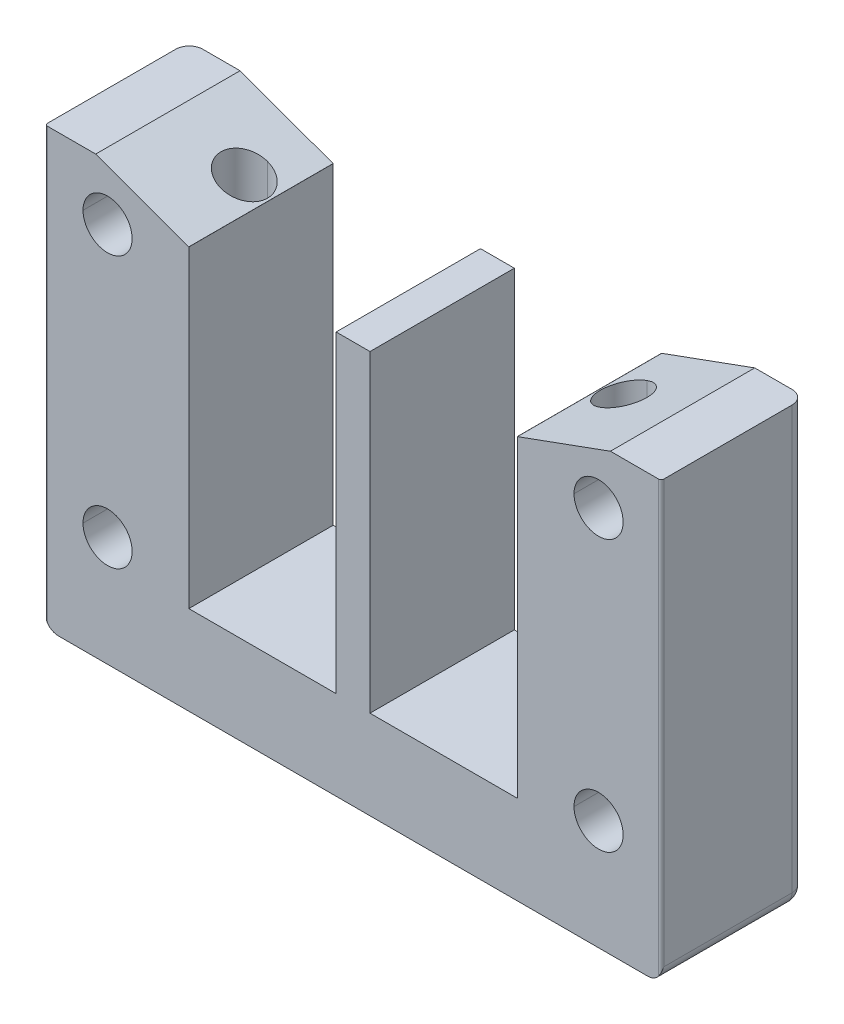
ISO-10303-21;
HEADER;
FILE_DESCRIPTION(('STEP AP214'),'2;1');
FILE_NAME('part.step','',(''),(''),'','','');
FILE_SCHEMA(('AUTOMOTIVE_DESIGN { 1 0 10303 214 1 1 1 1 }'));
ENDSEC;
DATA;
#1=APPLICATION_CONTEXT('core data for automotive mechanical design processes');
#2=APPLICATION_PROTOCOL_DEFINITION('international standard','automotive_design',2000,#1);
#3=PRODUCT_CONTEXT('',#1,'mechanical');
#4=PRODUCT('Part','Part','',(#3));
#5=PRODUCT_RELATED_PRODUCT_CATEGORY('part','',(#4));
#6=PRODUCT_DEFINITION_FORMATION('','',#4);
#7=PRODUCT_DEFINITION_CONTEXT('part definition',#1,'design');
#8=PRODUCT_DEFINITION('design','',#6,#7);
#9=PRODUCT_DEFINITION_SHAPE('','',#8);
#10=(LENGTH_UNIT() NAMED_UNIT(*) SI_UNIT(.MILLI.,.METRE.));
#11=(NAMED_UNIT(*) PLANE_ANGLE_UNIT() SI_UNIT($,.RADIAN.));
#12=(NAMED_UNIT(*) SI_UNIT($,.STERADIAN.) SOLID_ANGLE_UNIT());
#13=UNCERTAINTY_MEASURE_WITH_UNIT(LENGTH_MEASURE(1.E-05),#10,'distance_accuracy_value','');
#14=(GEOMETRIC_REPRESENTATION_CONTEXT(3) GLOBAL_UNCERTAINTY_ASSIGNED_CONTEXT((#13)) GLOBAL_UNIT_ASSIGNED_CONTEXT((#10,
#11,#12)) REPRESENTATION_CONTEXT('',''));
#15=CARTESIAN_POINT('',(0.,0.,0.));
#16=DIRECTION('',(0.,0.,1.));
#17=DIRECTION('',(1.,0.,0.));
#18=AXIS2_PLACEMENT_3D('',#15,#16,#17);
#19=CARTESIAN_POINT('',(-61.5719140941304,47.8391777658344,12.5060604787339));
#20=DIRECTION('',(0.,1.,0.));
#21=DIRECTION('',(1.,0.,0.));
#22=AXIS2_PLACEMENT_3D('',#19,#20,#21);
#23=PLANE('',#22);
#24=DIRECTION('',(0.,0.,-1.));
#25=VECTOR('',#24,1.);
#26=CARTESIAN_POINT('',(-61.5719140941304,47.8391777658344,12.5060604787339));
#27=LINE('',#26,#25);
#28=CARTESIAN_POINT('',(-61.5719140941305,47.8391777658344,12.2060604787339));
#29=VERTEX_POINT('',#28);
#30=CARTESIAN_POINT('',(-61.5719140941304,47.8391777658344,-2.94393952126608));
#31=VERTEX_POINT('',#30);
#32=EDGE_CURVE('E578',#29,#31,#27,.T.);
#33=ORIENTED_EDGE('',*,*,#32,.F.);
#34=CARTESIAN_POINT('',(-61.2719140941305,47.8391777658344,12.2060604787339));
#35=DIRECTION('',(0.,-1.,0.));
#36=DIRECTION('',(0.,0.,1.));
#37=AXIS2_PLACEMENT_3D('',#34,#35,#36);
#38=CIRCLE('',#37,0.3);
#39=CARTESIAN_POINT('',(-61.2719140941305,47.8391777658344,12.5060604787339));
#40=VERTEX_POINT('',#39);
#41=EDGE_CURVE('E581',#40,#29,#38,.T.);
#42=ORIENTED_EDGE('',*,*,#41,.F.);
#43=DIRECTION('',(1.,0.,0.));
#44=VECTOR('',#43,1.);
#45=CARTESIAN_POINT('',(-61.5719140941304,47.8391777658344,12.5060604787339));
#46=LINE('',#45,#44);
#47=CARTESIAN_POINT('',(-55.5719140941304,47.8391777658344,12.5060604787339));
#48=VERTEX_POINT('',#47);
#49=EDGE_CURVE('E474',#40,#48,#46,.T.);
#50=ORIENTED_EDGE('',*,*,#49,.T.);
#51=DIRECTION('',(0.,0.,-1.));
#52=VECTOR('',#51,1.);
#53=CARTESIAN_POINT('',(-55.5719140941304,47.8391777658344,12.5060604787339));
#54=LINE('',#53,#52);
#55=CARTESIAN_POINT('',(-55.5719140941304,47.8391777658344,-4.54393952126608));
#56=VERTEX_POINT('',#55);
#57=EDGE_CURVE('E25',#48,#56,#54,.T.);
#58=ORIENTED_EDGE('',*,*,#57,.T.);
#59=DIRECTION('',(1.,0.,0.));
#60=VECTOR('',#59,1.);
#61=CARTESIAN_POINT('',(-61.5719140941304,47.8391777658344,-4.54393952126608));
#62=LINE('',#61,#60);
#63=CARTESIAN_POINT('',(-59.9719140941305,47.8391777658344,-4.54393952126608));
#64=VERTEX_POINT('',#63);
#65=EDGE_CURVE('E1077',#64,#56,#62,.T.);
#66=ORIENTED_EDGE('',*,*,#65,.F.);
#67=CARTESIAN_POINT('',(-59.9719140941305,47.8391777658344,-2.94393952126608));
#68=DIRECTION('',(0.,-1.,0.));
#69=DIRECTION('',(0.,0.,1.));
#70=AXIS2_PLACEMENT_3D('',#67,#68,#69);
#71=CIRCLE('',#70,1.6);
#72=EDGE_CURVE('E584',#31,#64,#71,.T.);
#73=ORIENTED_EDGE('',*,*,#72,.F.);
#74=EDGE_LOOP('',(#33,#42,#50,#58,#66,#73));
#75=FACE_BOUND('',#74,.T.);
#76=ADVANCED_FACE('F15',(#75),#23,.T.);
#77=CARTESIAN_POINT('',(-5.76182377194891,43.8391777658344,12.5060604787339));
#78=DIRECTION('',(0.,1.,0.));
#79=DIRECTION('',(1.,0.,0.));
#80=AXIS2_PLACEMENT_3D('',#77,#78,#79);
#81=PLANE('',#80);
#82=DIRECTION('',(0.,0.,-1.));
#83=VECTOR('',#82,1.);
#84=CARTESIAN_POINT('',(-44.5719140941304,43.8391777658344,12.5060604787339));
#85=LINE('',#84,#83);
#86=CARTESIAN_POINT('',(-44.5719140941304,43.8391777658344,12.5060604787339));
#87=VERTEX_POINT('',#86);
#88=CARTESIAN_POINT('',(-44.5719140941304,43.8391777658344,-4.54393952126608));
#89=VERTEX_POINT('',#88);
#90=EDGE_CURVE('E1024',#87,#89,#85,.T.);
#91=ORIENTED_EDGE('',*,*,#90,.T.);
#92=DIRECTION('',(1.,0.,0.));
#93=VECTOR('',#92,1.);
#94=CARTESIAN_POINT('',(-5.76182377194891,43.8391777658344,-4.54393952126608));
#95=LINE('',#94,#93);
#96=CARTESIAN_POINT('',(-44.582004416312,43.8391777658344,-4.54393952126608));
#97=VERTEX_POINT('',#96);
#98=EDGE_CURVE('E464',#97,#89,#95,.T.);
#99=ORIENTED_EDGE('',*,*,#98,.F.);
#100=DIRECTION('',(0.,0.,-1.));
#101=VECTOR('',#100,1.);
#102=CARTESIAN_POINT('',(-44.582004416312,43.8391777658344,12.5060604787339));
#103=LINE('',#102,#101);
#104=CARTESIAN_POINT('',(-44.582004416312,43.8391777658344,12.5060604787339));
#105=VERTEX_POINT('',#104);
#106=EDGE_CURVE('E10',#105,#97,#103,.T.);
#107=ORIENTED_EDGE('',*,*,#106,.F.);
#108=DIRECTION('',(1.,0.,0.));
#109=VECTOR('',#108,1.);
#110=CARTESIAN_POINT('',(-5.76182377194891,43.8391777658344,12.5060604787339));
#111=LINE('',#110,#109);
#112=EDGE_CURVE('E462',#105,#87,#111,.T.);
#113=ORIENTED_EDGE('',*,*,#112,.T.);
#114=EDGE_LOOP('',(#91,#99,#107,#113));
#115=FACE_BOUND('',#114,.T.);
#116=ADVANCED_FACE('F460',(#115),#81,.T.);
#117=CARTESIAN_POINT('',(-55.5719140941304,47.8391777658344,12.5060604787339));
#118=DIRECTION('',(0.342020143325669,0.939692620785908,0.));
#119=DIRECTION('',(0.,0.,-1.));
#120=AXIS2_PLACEMENT_3D('',#117,#118,#119);
#121=PLANE('',#120);
#122=CARTESIAN_POINT('',(-47.5719140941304,44.9274158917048,5.70606047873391));
#123=CARTESIAN_POINT('',(-53.0719140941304,46.9292521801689,5.70606047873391));
#124=CARTESIAN_POINT('',(-53.0719140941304,46.9292521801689,0.20606047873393));
#125=CARTESIAN_POINT('',(-47.5719140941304,44.9274158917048,0.20606047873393));
#126=(BOUNDED_CURVE() B_SPLINE_CURVE(3,(#122,#123,#124,#125),.UNSPECIFIED.,.F.,
.F.) B_SPLINE_CURVE_WITH_KNOTS((4,4),(4.71238898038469,7.85398163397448),
.UNSPECIFIED.) CURVE() GEOMETRIC_REPRESENTATION_ITEM() RATIONAL_B_SPLINE_CURVE((1.,
0.333333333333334,0.333333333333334,1.)) REPRESENTATION_ITEM(''));
#127=CARTESIAN_POINT('',(-47.5719140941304,44.9274158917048,5.70606047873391));
#128=VERTEX_POINT('',#127);
#129=CARTESIAN_POINT('',(-47.5719140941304,44.9274158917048,0.20606047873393));
#130=VERTEX_POINT('',#129);
#131=EDGE_CURVE('E786',#128,#130,#126,.T.);
#132=ORIENTED_EDGE('',*,*,#131,.T.);
#133=CARTESIAN_POINT('',(-47.5719140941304,44.9274158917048,0.20606047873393));
#134=CARTESIAN_POINT('',(-42.0719140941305,42.9255796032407,0.20606047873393));
#135=CARTESIAN_POINT('',(-42.0719140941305,42.9255796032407,5.70606047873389));
#136=CARTESIAN_POINT('',(-47.5719140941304,44.9274158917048,5.70606047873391));
#137=(BOUNDED_CURVE() B_SPLINE_CURVE(3,(#133,#134,#135,#136),.UNSPECIFIED.,.F.,
.F.) B_SPLINE_CURVE_WITH_KNOTS((4,4),(1.5707963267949,4.71238898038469),
.UNSPECIFIED.) CURVE() GEOMETRIC_REPRESENTATION_ITEM() RATIONAL_B_SPLINE_CURVE((1.,
0.333333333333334,0.333333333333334,1.)) REPRESENTATION_ITEM(''));
#138=EDGE_CURVE('E683',#130,#128,#137,.T.);
#139=ORIENTED_EDGE('',*,*,#138,.T.);
#140=EDGE_LOOP('',(#132,#139));
#141=FACE_BOUND('',#140,.T.);
#142=DIRECTION('',(0.939692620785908,-0.342020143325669,0.));
#143=VECTOR('',#142,1.);
#144=CARTESIAN_POINT('',(-55.5719140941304,47.8391777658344,-4.54393952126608));
#145=LINE('',#144,#143);
#146=EDGE_CURVE('E1078',#56,#97,#145,.T.);
#147=ORIENTED_EDGE('',*,*,#146,.F.);
#148=ORIENTED_EDGE('',*,*,#57,.F.);
#149=DIRECTION('',(0.939692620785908,-0.342020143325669,0.));
#150=VECTOR('',#149,1.);
#151=CARTESIAN_POINT('',(-55.5719140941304,47.8391777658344,12.5060604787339));
#152=LINE('',#151,#150);
#153=EDGE_CURVE('E469',#48,#105,#152,.T.);
#154=ORIENTED_EDGE('',*,*,#153,.T.);
#155=ORIENTED_EDGE('',*,*,#106,.T.);
#156=EDGE_LOOP('',(#147,#148,#154,#155));
#157=FACE_BOUND('',#156,.T.);
#158=ADVANCED_FACE('F470',(#141,#157),#121,.T.);
#159=CARTESIAN_POINT('',(5.22808590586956,47.8391777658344,12.5060604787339));
#160=DIRECTION('',(-0.342020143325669,0.939692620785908,0.));
#161=DIRECTION('',(0.,0.,1.));
#162=AXIS2_PLACEMENT_3D('',#159,#160,#161);
#163=PLANE('',#162);
#164=CARTESIAN_POINT('',(-2.77191409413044,44.9274158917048,5.70606047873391));
#165=CARTESIAN_POINT('',(-8.27191409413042,42.9255796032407,5.70606047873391));
#166=CARTESIAN_POINT('',(-8.27191409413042,42.9255796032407,0.20606047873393));
#167=CARTESIAN_POINT('',(-2.77191409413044,44.9274158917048,0.20606047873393));
#168=(BOUNDED_CURVE() B_SPLINE_CURVE(3,(#164,#165,#166,#167),.UNSPECIFIED.,.F.,
.F.) B_SPLINE_CURVE_WITH_KNOTS((4,4),(1.5707963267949,4.71238898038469),
.UNSPECIFIED.) CURVE() GEOMETRIC_REPRESENTATION_ITEM() RATIONAL_B_SPLINE_CURVE((1.,
0.333333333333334,0.333333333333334,1.)) REPRESENTATION_ITEM(''));
#169=CARTESIAN_POINT('',(-2.77191409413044,44.9274158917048,5.70606047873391));
#170=VERTEX_POINT('',#169);
#171=CARTESIAN_POINT('',(-2.77191409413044,44.9274158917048,0.20606047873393));
#172=VERTEX_POINT('',#171);
#173=EDGE_CURVE('E815',#170,#172,#168,.T.);
#174=ORIENTED_EDGE('',*,*,#173,.T.);
#175=CARTESIAN_POINT('',(-2.77191409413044,44.9274158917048,0.20606047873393));
#176=CARTESIAN_POINT('',(2.72808590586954,46.9292521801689,0.206060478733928));
#177=CARTESIAN_POINT('',(2.72808590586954,46.9292521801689,5.70606047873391));
#178=CARTESIAN_POINT('',(-2.77191409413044,44.9274158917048,5.70606047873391));
#179=(BOUNDED_CURVE() B_SPLINE_CURVE(3,(#175,#176,#177,#178),.UNSPECIFIED.,.F.,
.F.) B_SPLINE_CURVE_WITH_KNOTS((4,4),(4.71238898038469,7.85398163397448),
.UNSPECIFIED.) CURVE() GEOMETRIC_REPRESENTATION_ITEM() RATIONAL_B_SPLINE_CURVE((1.,
0.333333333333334,0.333333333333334,1.)) REPRESENTATION_ITEM(''));
#180=EDGE_CURVE('E739',#172,#170,#179,.T.);
#181=ORIENTED_EDGE('',*,*,#180,.T.);
#182=EDGE_LOOP('',(#174,#181));
#183=FACE_BOUND('',#182,.T.);
#184=DIRECTION('',(0.939692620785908,0.342020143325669,0.));
#185=VECTOR('',#184,1.);
#186=CARTESIAN_POINT('',(5.22808590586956,47.8391777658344,-4.54393952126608));
#187=LINE('',#186,#185);
#188=CARTESIAN_POINT('',(-5.76182377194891,43.8391777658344,-4.54393952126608));
#189=VERTEX_POINT('',#188);
#190=CARTESIAN_POINT('',(5.22808590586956,47.8391777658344,-4.54393952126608));
#191=VERTEX_POINT('',#190);
#192=EDGE_CURVE('E1070',#189,#191,#187,.T.);
#193=ORIENTED_EDGE('',*,*,#192,.F.);
#194=DIRECTION('',(0.,0.,-1.));
#195=VECTOR('',#194,1.);
#196=CARTESIAN_POINT('',(-5.76182377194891,43.8391777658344,12.5060604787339));
#197=LINE('',#196,#195);
#198=CARTESIAN_POINT('',(-5.76182377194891,43.8391777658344,12.5060604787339));
#199=VERTEX_POINT('',#198);
#200=EDGE_CURVE('E38',#199,#189,#197,.T.);
#201=ORIENTED_EDGE('',*,*,#200,.F.);
#202=DIRECTION('',(0.939692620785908,0.342020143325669,0.));
#203=VECTOR('',#202,1.);
#204=CARTESIAN_POINT('',(5.22808590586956,47.8391777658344,12.5060604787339));
#205=LINE('',#204,#203);
#206=CARTESIAN_POINT('',(5.22808590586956,47.8391777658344,12.5060604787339));
#207=VERTEX_POINT('',#206);
#208=EDGE_CURVE('E496',#199,#207,#205,.T.);
#209=ORIENTED_EDGE('',*,*,#208,.T.);
#210=DIRECTION('',(0.,0.,-1.));
#211=VECTOR('',#210,1.);
#212=CARTESIAN_POINT('',(5.22808590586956,47.8391777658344,12.5060604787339));
#213=LINE('',#212,#211);
#214=EDGE_CURVE('E499',#207,#191,#213,.T.);
#215=ORIENTED_EDGE('',*,*,#214,.T.);
#216=EDGE_LOOP('',(#193,#201,#209,#215));
#217=FACE_BOUND('',#216,.T.);
#218=ADVANCED_FACE('F561',(#183,#217),#163,.T.);
#219=CARTESIAN_POINT('',(11.2280859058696,47.8391777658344,12.5060604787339));
#220=DIRECTION('',(0.,1.,0.));
#221=DIRECTION('',(1.,0.,0.));
#222=AXIS2_PLACEMENT_3D('',#219,#220,#221);
#223=PLANE('',#222);
#224=DIRECTION('',(1.,0.,0.));
#225=VECTOR('',#224,1.);
#226=CARTESIAN_POINT('',(11.2280859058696,47.8391777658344,-4.54393952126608));
#227=LINE('',#226,#225);
#228=CARTESIAN_POINT('',(9.62808590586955,47.8391777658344,-4.54393952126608));
#229=VERTEX_POINT('',#228);
#230=EDGE_CURVE('E1074',#191,#229,#227,.T.);
#231=ORIENTED_EDGE('',*,*,#230,.F.);
#232=ORIENTED_EDGE('',*,*,#214,.F.);
#233=DIRECTION('',(1.,0.,0.));
#234=VECTOR('',#233,1.);
#235=CARTESIAN_POINT('',(11.2280859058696,47.8391777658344,12.5060604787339));
#236=LINE('',#235,#234);
#237=CARTESIAN_POINT('',(10.9280859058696,47.8391777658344,12.5060604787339));
#238=VERTEX_POINT('',#237);
#239=EDGE_CURVE('E492',#207,#238,#236,.T.);
#240=ORIENTED_EDGE('',*,*,#239,.T.);
#241=CARTESIAN_POINT('',(10.9280859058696,47.8391777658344,12.2060604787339));
#242=DIRECTION('',(0.,-1.,0.));
#243=DIRECTION('',(0.,0.,1.));
#244=AXIS2_PLACEMENT_3D('',#241,#242,#243);
#245=CIRCLE('',#244,0.3);
#246=CARTESIAN_POINT('',(11.2280859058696,47.8391777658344,12.2060604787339));
#247=VERTEX_POINT('',#246);
#248=EDGE_CURVE('E1083',#247,#238,#245,.T.);
#249=ORIENTED_EDGE('',*,*,#248,.F.);
#250=DIRECTION('',(0.,0.,-1.));
#251=VECTOR('',#250,1.);
#252=CARTESIAN_POINT('',(11.2280859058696,47.8391777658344,12.5060604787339));
#253=LINE('',#252,#251);
#254=CARTESIAN_POINT('',(11.2280859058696,47.8391777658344,-2.94393952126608));
#255=VERTEX_POINT('',#254);
#256=EDGE_CURVE('E486',#247,#255,#253,.T.);
#257=ORIENTED_EDGE('',*,*,#256,.T.);
#258=CARTESIAN_POINT('',(9.62808590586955,47.8391777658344,-2.94393952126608));
#259=DIRECTION('',(0.,-1.,0.));
#260=DIRECTION('',(0.,0.,1.));
#261=AXIS2_PLACEMENT_3D('',#258,#259,#260);
#262=CIRCLE('',#261,1.6);
#263=EDGE_CURVE('E956',#229,#255,#262,.T.);
#264=ORIENTED_EDGE('',*,*,#263,.F.);
#265=EDGE_LOOP('',(#231,#232,#240,#249,#257,#264));
#266=FACE_BOUND('',#265,.T.);
#267=ADVANCED_FACE('F563',(#266),#223,.T.);
#268=CARTESIAN_POINT('',(-5.76182377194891,43.8391777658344,12.5060604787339));
#269=DIRECTION('',(0.,1.,0.));
#270=DIRECTION('',(1.,0.,0.));
#271=AXIS2_PLACEMENT_3D('',#268,#269,#270);
#272=PLANE('',#271);
#273=DIRECTION('',(0.,0.,-1.));
#274=VECTOR('',#273,1.);
#275=CARTESIAN_POINT('',(-5.77191409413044,43.8391777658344,12.5060604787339));
#276=LINE('',#275,#274);
#277=CARTESIAN_POINT('',(-5.77191409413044,43.8391777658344,12.5060604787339));
#278=VERTEX_POINT('',#277);
#279=CARTESIAN_POINT('',(-5.77191409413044,43.8391777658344,-4.54393952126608));
#280=VERTEX_POINT('',#279);
#281=EDGE_CURVE('E1049',#278,#280,#276,.T.);
#282=ORIENTED_EDGE('',*,*,#281,.F.);
#283=DIRECTION('',(1.,0.,0.));
#284=VECTOR('',#283,1.);
#285=CARTESIAN_POINT('',(-5.76182377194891,43.8391777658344,12.5060604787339));
#286=LINE('',#285,#284);
#287=EDGE_CURVE('E493',#278,#199,#286,.T.);
#288=ORIENTED_EDGE('',*,*,#287,.T.);
#289=ORIENTED_EDGE('',*,*,#200,.T.);
#290=DIRECTION('',(1.,0.,0.));
#291=VECTOR('',#290,1.);
#292=CARTESIAN_POINT('',(-5.76182377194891,43.8391777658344,-4.54393952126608));
#293=LINE('',#292,#291);
#294=EDGE_CURVE('E1066',#280,#189,#293,.T.);
#295=ORIENTED_EDGE('',*,*,#294,.F.);
#296=EDGE_LOOP('',(#282,#288,#289,#295));
#297=FACE_BOUND('',#296,.T.);
#298=ADVANCED_FACE('F559',(#297),#272,.T.);
#299=CARTESIAN_POINT('',(-5.76182377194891,43.8391777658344,12.5060604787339));
#300=DIRECTION('',(0.,1.,0.));
#301=DIRECTION('',(1.,0.,0.));
#302=AXIS2_PLACEMENT_3D('',#299,#300,#301);
#303=PLANE('',#302);
#304=DIRECTION('',(1.,0.,0.));
#305=VECTOR('',#304,1.);
#306=CARTESIAN_POINT('',(-5.76182377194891,43.8391777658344,12.5060604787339));
#307=LINE('',#306,#305);
#308=CARTESIAN_POINT('',(-27.1719140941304,43.8391777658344,12.5060604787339));
#309=VERTEX_POINT('',#308);
#310=CARTESIAN_POINT('',(-23.1719140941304,43.8391777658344,12.5060604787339));
#311=VERTEX_POINT('',#310);
#312=EDGE_CURVE('E482',#309,#311,#307,.T.);
#313=ORIENTED_EDGE('',*,*,#312,.T.);
#314=DIRECTION('',(0.,0.,-1.));
#315=VECTOR('',#314,1.);
#316=CARTESIAN_POINT('',(-23.1719140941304,43.8391777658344,49.7216486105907));
#317=LINE('',#316,#315);
#318=CARTESIAN_POINT('',(-23.1719140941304,43.8391777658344,-4.54393952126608));
#319=VERTEX_POINT('',#318);
#320=EDGE_CURVE('E1053',#311,#319,#317,.T.);
#321=ORIENTED_EDGE('',*,*,#320,.T.);
#322=DIRECTION('',(1.,0.,0.));
#323=VECTOR('',#322,1.);
#324=CARTESIAN_POINT('',(-5.76182377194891,43.8391777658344,-4.54393952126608));
#325=LINE('',#324,#323);
#326=CARTESIAN_POINT('',(-27.1719140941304,43.8391777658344,-4.54393952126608));
#327=VERTEX_POINT('',#326);
#328=EDGE_CURVE('E1063',#327,#319,#325,.T.);
#329=ORIENTED_EDGE('',*,*,#328,.F.);
#330=DIRECTION('',(0.,0.,-1.));
#331=VECTOR('',#330,1.);
#332=CARTESIAN_POINT('',(-27.1719140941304,43.8391777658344,49.7216486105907));
#333=LINE('',#332,#331);
#334=EDGE_CURVE('E943',#309,#327,#333,.T.);
#335=ORIENTED_EDGE('',*,*,#334,.F.);
#336=EDGE_LOOP('',(#313,#321,#329,#335));
#337=FACE_BOUND('',#336,.T.);
#338=ADVANCED_FACE('F556',(#337),#303,.T.);
#339=CARTESIAN_POINT('',(-25.1719140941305,25.3391777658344,12.5060604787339));
#340=DIRECTION('',(0.,0.,1.));
#341=DIRECTION('',(1.,0.,0.));
#342=AXIS2_PLACEMENT_3D('',#339,#340,#341);
#343=PLANE('',#342);
#344=CARTESIAN_POINT('',(-54.1719140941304,9.33917776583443,12.5060604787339));
#345=DIRECTION('',(0.,0.,-1.));
#346=DIRECTION('',(-1.,0.,0.));
#347=AXIS2_PLACEMENT_3D('',#344,#345,#346);
#348=CIRCLE('',#347,2.9);
#349=CARTESIAN_POINT('',(-57.0719140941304,9.33917776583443,12.5060604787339));
#350=VERTEX_POINT('',#349);
#351=CARTESIAN_POINT('',(-51.2719140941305,9.33917776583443,12.5060604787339));
#352=VERTEX_POINT('',#351);
#353=EDGE_CURVE('E777',#350,#352,#348,.T.);
#354=ORIENTED_EDGE('',*,*,#353,.T.);
#355=CARTESIAN_POINT('',(-54.1719140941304,9.33917776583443,12.5060604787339));
#356=DIRECTION('',(0.,0.,-1.));
#357=DIRECTION('',(-1.,0.,0.));
#358=AXIS2_PLACEMENT_3D('',#355,#356,#357);
#359=CIRCLE('',#358,2.9);
#360=EDGE_CURVE('E735',#352,#350,#359,.T.);
#361=ORIENTED_EDGE('',*,*,#360,.T.);
#362=EDGE_LOOP('',(#354,#361));
#363=FACE_BOUND('',#362,.T.);
#364=CARTESIAN_POINT('',(-54.1719140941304,41.3391777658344,12.5060604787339));
#365=DIRECTION('',(0.,0.,-1.));
#366=DIRECTION('',(-1.,0.,0.));
#367=AXIS2_PLACEMENT_3D('',#364,#365,#366);
#368=CIRCLE('',#367,2.9);
#369=CARTESIAN_POINT('',(-57.0719140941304,41.3391777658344,12.5060604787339));
#370=VERTEX_POINT('',#369);
#371=CARTESIAN_POINT('',(-51.2719140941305,41.3391777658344,12.5060604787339));
#372=VERTEX_POINT('',#371);
#373=EDGE_CURVE('E828',#370,#372,#368,.T.);
#374=ORIENTED_EDGE('',*,*,#373,.T.);
#375=CARTESIAN_POINT('',(-54.1719140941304,41.3391777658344,12.5060604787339));
#376=DIRECTION('',(0.,0.,-1.));
#377=DIRECTION('',(-1.,0.,0.));
#378=AXIS2_PLACEMENT_3D('',#375,#376,#377);
#379=CIRCLE('',#378,2.9);
#380=EDGE_CURVE('E700',#372,#370,#379,.T.);
#381=ORIENTED_EDGE('',*,*,#380,.T.);
#382=EDGE_LOOP('',(#374,#381));
#383=FACE_BOUND('',#382,.T.);
#384=CARTESIAN_POINT('',(3.82808590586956,9.33917776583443,12.5060604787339));
#385=DIRECTION('',(0.,0.,-1.));
#386=DIRECTION('',(-1.,0.,0.));
#387=AXIS2_PLACEMENT_3D('',#384,#385,#386);
#388=CIRCLE('',#387,2.9);
#389=CARTESIAN_POINT('',(0.928085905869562,9.33917776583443,12.5060604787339));
#390=VERTEX_POINT('',#389);
#391=CARTESIAN_POINT('',(6.72808590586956,9.33917776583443,12.5060604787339));
#392=VERTEX_POINT('',#391);
#393=EDGE_CURVE('E822',#390,#392,#388,.T.);
#394=ORIENTED_EDGE('',*,*,#393,.T.);
#395=CARTESIAN_POINT('',(3.82808590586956,9.33917776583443,12.5060604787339));
#396=DIRECTION('',(0.,0.,-1.));
#397=DIRECTION('',(-1.,0.,0.));
#398=AXIS2_PLACEMENT_3D('',#395,#396,#397);
#399=CIRCLE('',#398,2.9);
#400=EDGE_CURVE('E668',#392,#390,#399,.T.);
#401=ORIENTED_EDGE('',*,*,#400,.T.);
#402=EDGE_LOOP('',(#394,#401));
#403=FACE_BOUND('',#402,.T.);
#404=CARTESIAN_POINT('',(3.82808590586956,41.3391777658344,12.5060604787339));
#405=DIRECTION('',(0.,0.,-1.));
#406=DIRECTION('',(-1.,0.,0.));
#407=AXIS2_PLACEMENT_3D('',#404,#405,#406);
#408=CIRCLE('',#407,2.9);
#409=CARTESIAN_POINT('',(0.928085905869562,41.3391777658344,12.5060604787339));
#410=VERTEX_POINT('',#409);
#411=CARTESIAN_POINT('',(6.72808590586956,41.3391777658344,12.5060604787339));
#412=VERTEX_POINT('',#411);
#413=EDGE_CURVE('E626',#410,#412,#408,.T.);
#414=ORIENTED_EDGE('',*,*,#413,.T.);
#415=CARTESIAN_POINT('',(3.82808590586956,41.3391777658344,12.5060604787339));
#416=DIRECTION('',(0.,0.,-1.));
#417=DIRECTION('',(-1.,0.,0.));
#418=AXIS2_PLACEMENT_3D('',#415,#416,#417);
#419=CIRCLE('',#418,2.9);
#420=EDGE_CURVE('E646',#412,#410,#419,.T.);
#421=ORIENTED_EDGE('',*,*,#420,.T.);
#422=EDGE_LOOP('',(#414,#421));
#423=FACE_BOUND('',#422,.T.);
#424=DIRECTION('',(0.,-1.,0.));
#425=VECTOR('',#424,1.);
#426=CARTESIAN_POINT('',(-23.1719140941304,6.83917776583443,12.5060604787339));
#427=LINE('',#426,#425);
#428=CARTESIAN_POINT('',(-23.1719140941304,6.83917776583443,12.5060604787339));
#429=VERTEX_POINT('',#428);
#430=EDGE_CURVE('E1057',#311,#429,#427,.T.);
#431=ORIENTED_EDGE('',*,*,#430,.F.);
#432=ORIENTED_EDGE('',*,*,#312,.F.);
#433=DIRECTION('',(0.,1.,0.));
#434=VECTOR('',#433,1.);
#435=CARTESIAN_POINT('',(-27.1719140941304,6.83917776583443,12.5060604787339));
#436=LINE('',#435,#434);
#437=CARTESIAN_POINT('',(-27.1719140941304,6.83917776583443,12.5060604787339));
#438=VERTEX_POINT('',#437);
#439=EDGE_CURVE('E597',#438,#309,#436,.T.);
#440=ORIENTED_EDGE('',*,*,#439,.F.);
#441=DIRECTION('',(-1.,0.,0.));
#442=VECTOR('',#441,1.);
#443=CARTESIAN_POINT('',(-5.77191409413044,6.83917776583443,12.5060604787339));
#444=LINE('',#443,#442);
#445=CARTESIAN_POINT('',(-44.5719140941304,6.83917776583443,12.5060604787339));
#446=VERTEX_POINT('',#445);
#447=EDGE_CURVE('E1000',#438,#446,#444,.T.);
#448=ORIENTED_EDGE('',*,*,#447,.T.);
#449=DIRECTION('',(0.,1.,0.));
#450=VECTOR('',#449,1.);
#451=CARTESIAN_POINT('',(-44.5719140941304,43.8391777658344,12.5060604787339));
#452=LINE('',#451,#450);
#453=EDGE_CURVE('E479',#446,#87,#452,.T.);
#454=ORIENTED_EDGE('',*,*,#453,.T.);
#455=ORIENTED_EDGE('',*,*,#112,.F.);
#456=ORIENTED_EDGE('',*,*,#153,.F.);
#457=ORIENTED_EDGE('',*,*,#49,.F.);
#458=DIRECTION('',(0.,-1.,0.));
#459=VECTOR('',#458,1.);
#460=CARTESIAN_POINT('',(-61.2719140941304,-3.66082223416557,12.5060604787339));
#461=LINE('',#460,#459);
#462=CARTESIAN_POINT('',(-61.2719140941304,-2.99356013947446,12.5060604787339));
#463=VERTEX_POINT('',#462);
#464=EDGE_CURVE('E599',#40,#463,#461,.T.);
#465=ORIENTED_EDGE('',*,*,#464,.T.);
#466=CARTESIAN_POINT('',(-59.9719140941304,-2.06082223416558,12.5060604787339));
#467=DIRECTION('',(0.,0.,1.));
#468=DIRECTION('',(1.,0.,0.));
#469=AXIS2_PLACEMENT_3D('',#466,#467,#468);
#470=CIRCLE('',#469,1.6);
#471=CARTESIAN_POINT('',(-59.9719140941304,-3.66082223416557,12.5060604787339));
#472=VERTEX_POINT('',#471);
#473=EDGE_CURVE('E1116',#463,#472,#470,.T.);
#474=ORIENTED_EDGE('',*,*,#473,.T.);
#475=DIRECTION('',(1.,0.,0.));
#476=VECTOR('',#475,1.);
#477=CARTESIAN_POINT('',(-61.5719140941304,-3.66082223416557,12.5060604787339));
#478=LINE('',#477,#476);
#479=CARTESIAN_POINT('',(9.62808590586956,-3.66082223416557,12.5060604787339));
#480=VERTEX_POINT('',#479);
#481=EDGE_CURVE('E897',#472,#480,#478,.T.);
#482=ORIENTED_EDGE('',*,*,#481,.T.);
#483=CARTESIAN_POINT('',(9.62808590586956,-2.06082223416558,12.5060604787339));
#484=DIRECTION('',(0.,0.,1.));
#485=DIRECTION('',(1.,0.,0.));
#486=AXIS2_PLACEMENT_3D('',#483,#484,#485);
#487=CIRCLE('',#486,1.6);
#488=CARTESIAN_POINT('',(10.9280859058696,-2.99356013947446,12.5060604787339));
#489=VERTEX_POINT('',#488);
#490=EDGE_CURVE('E1004',#480,#489,#487,.T.);
#491=ORIENTED_EDGE('',*,*,#490,.T.);
#492=DIRECTION('',(0.,1.,0.));
#493=VECTOR('',#492,1.);
#494=CARTESIAN_POINT('',(10.9280859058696,52.7391777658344,12.5060604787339));
#495=LINE('',#494,#493);
#496=EDGE_CURVE('E1086',#489,#238,#495,.T.);
#497=ORIENTED_EDGE('',*,*,#496,.T.);
#498=ORIENTED_EDGE('',*,*,#239,.F.);
#499=ORIENTED_EDGE('',*,*,#208,.F.);
#500=ORIENTED_EDGE('',*,*,#287,.F.);
#501=DIRECTION('',(0.,-1.,0.));
#502=VECTOR('',#501,1.);
#503=CARTESIAN_POINT('',(-5.77191409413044,43.8391777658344,12.5060604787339));
#504=LINE('',#503,#502);
#505=CARTESIAN_POINT('',(-5.77191409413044,6.83917776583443,12.5060604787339));
#506=VERTEX_POINT('',#505);
#507=EDGE_CURVE('E1046',#278,#506,#504,.T.);
#508=ORIENTED_EDGE('',*,*,#507,.T.);
#509=DIRECTION('',(-1.,0.,0.));
#510=VECTOR('',#509,1.);
#511=CARTESIAN_POINT('',(-5.77191409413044,6.83917776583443,12.5060604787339));
#512=LINE('',#511,#510);
#513=EDGE_CURVE('E787',#506,#429,#512,.T.);
#514=ORIENTED_EDGE('',*,*,#513,.T.);
#515=EDGE_LOOP('',(#431,#432,#440,#448,#454,#455,#456,#457,#465,#474,#482,#491,#497,#498,#499,
#500,#508,#514));
#516=FACE_BOUND('',#515,.T.);
#517=ADVANCED_FACE('F477',(#363,#383,#403,#423,#516),#343,.T.);
#518=CARTESIAN_POINT('',(11.2280859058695,54.3391777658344,12.5060604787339));
#519=DIRECTION('',(-1.,0.,0.));
#520=DIRECTION('',(0.,1.,0.));
#521=AXIS2_PLACEMENT_3D('',#518,#519,#520);
#522=PLANE('',#521);
#523=ORIENTED_EDGE('',*,*,#256,.F.);
#524=DIRECTION('',(0.,-1.,0.));
#525=VECTOR('',#524,1.);
#526=CARTESIAN_POINT('',(11.2280859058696,-3.66082223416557,12.2060604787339));
#527=LINE('',#526,#525);
#528=CARTESIAN_POINT('',(11.2280859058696,-2.06082223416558,12.2060604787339));
#529=VERTEX_POINT('',#528);
#530=EDGE_CURVE('E587',#247,#529,#527,.T.);
#531=ORIENTED_EDGE('',*,*,#530,.T.);
#532=DIRECTION('',(0.,0.,-1.));
#533=VECTOR('',#532,1.);
#534=CARTESIAN_POINT('',(11.2280859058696,-2.06082223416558,12.5060604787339));
#535=LINE('',#534,#533);
#536=CARTESIAN_POINT('',(11.2280859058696,-2.06082223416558,-2.94393952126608));
#537=VERTEX_POINT('',#536);
#538=EDGE_CURVE('E1112',#529,#537,#535,.T.);
#539=ORIENTED_EDGE('',*,*,#538,.T.);
#540=DIRECTION('',(0.,1.,0.));
#541=VECTOR('',#540,1.);
#542=CARTESIAN_POINT('',(11.2280859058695,54.3391777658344,-2.94393952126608));
#543=LINE('',#542,#541);
#544=EDGE_CURVE('E951',#537,#255,#543,.T.);
#545=ORIENTED_EDGE('',*,*,#544,.T.);
#546=EDGE_LOOP('',(#523,#531,#539,#545));
#547=FACE_BOUND('',#546,.T.);
#548=ADVANCED_FACE('F527',(#547),#522,.F.);
#549=CARTESIAN_POINT('',(10.9280859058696,25.3391777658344,12.2060604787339));
#550=DIRECTION('',(0.,-1.,0.));
#551=DIRECTION('',(1.,0.,0.));
#552=AXIS2_PLACEMENT_3D('',#549,#550,#551);
#553=CYLINDRICAL_SURFACE('',#552,0.3);
#554=ORIENTED_EDGE('',*,*,#530,.F.);
#555=ORIENTED_EDGE('',*,*,#248,.T.);
#556=ORIENTED_EDGE('',*,*,#496,.F.);
#557=CARTESIAN_POINT('',(10.9280859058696,-2.99356013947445,12.5060604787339));
#558=CARTESIAN_POINT('',(10.9331419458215,-2.98651306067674,12.506060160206));
#559=CARTESIAN_POINT('',(10.9381365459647,-2.97942260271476,12.5059326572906));
#560=CARTESIAN_POINT('',(10.948166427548,-2.96492525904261,12.5054312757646));
#561=CARTESIAN_POINT('',(10.9531974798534,-2.95751572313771,12.5050492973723));
#562=CARTESIAN_POINT('',(10.9632870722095,-2.94238035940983,12.5040326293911));
#563=CARTESIAN_POINT('',(10.9683411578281,-2.93465209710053,12.5033901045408));
#564=CARTESIAN_POINT('',(10.9784629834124,-2.91887900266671,12.5018461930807));
#565=CARTESIAN_POINT('',(10.9835260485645,-2.91083191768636,12.5009372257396));
#566=CARTESIAN_POINT('',(10.9936513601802,-2.89442095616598,12.4988551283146));
#567=CARTESIAN_POINT('',(10.9987087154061,-2.88605499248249,12.4976746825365));
#568=CARTESIAN_POINT('',(11.0088072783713,-2.86900638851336,12.4950450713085));
#569=CARTESIAN_POINT('',(11.0138433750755,-2.86032182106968,12.4935888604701));
#570=CARTESIAN_POINT('',(11.0291232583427,-2.83340640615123,12.4887422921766));
#571=CARTESIAN_POINT('',(11.0390692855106,-2.81507321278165,12.4849718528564));
#572=CARTESIAN_POINT('',(11.0587226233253,-2.77714584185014,12.4763485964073));
#573=CARTESIAN_POINT('',(11.0683840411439,-2.75753933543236,12.471446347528));
#574=CARTESIAN_POINT('',(11.0873306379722,-2.71706220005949,12.4605538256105));
#575=CARTESIAN_POINT('',(11.0965668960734,-2.69618074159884,12.4545189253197));
#576=CARTESIAN_POINT('',(11.1145160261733,-2.65315154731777,12.4413772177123));
#577=CARTESIAN_POINT('',(11.1231769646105,-2.63099427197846,12.4342310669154));
#578=CARTESIAN_POINT('',(11.1398352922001,-2.58541678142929,12.4188900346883));
#579=CARTESIAN_POINT('',(11.1477785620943,-2.56198837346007,12.4106607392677));
#580=CARTESIAN_POINT('',(11.159341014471,-2.52498009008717,12.3972744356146));
#581=CARTESIAN_POINT('',(11.1633607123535,-2.51145657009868,12.392302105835));
#582=CARTESIAN_POINT('',(11.1715194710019,-2.48259092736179,12.3815355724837));
#583=CARTESIAN_POINT('',(11.1756054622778,-2.46724213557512,12.3757188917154));
#584=CARTESIAN_POINT('',(11.1837589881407,-2.43472814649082,12.3632014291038));
#585=CARTESIAN_POINT('',(11.1877697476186,-2.41755815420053,12.3564761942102));
#586=CARTESIAN_POINT('',(11.1956070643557,-2.38139941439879,12.3420981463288));
#587=CARTESIAN_POINT('',(11.1993714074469,-2.36240667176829,12.3344214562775));
#588=CARTESIAN_POINT('',(11.2065292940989,-2.32260201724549,12.31811327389));
#589=CARTESIAN_POINT('',(11.2098547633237,-2.30178685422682,12.3094598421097));
#590=CARTESIAN_POINT('',(11.2159262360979,-2.2583366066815,12.2911975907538));
#591=CARTESIAN_POINT('',(11.2185979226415,-2.23569878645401,12.2815705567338));
#592=CARTESIAN_POINT('',(11.2231338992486,-2.18860290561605,12.2613941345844));
#593=CARTESIAN_POINT('',(11.224917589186,-2.16414253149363,12.2508320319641));
#594=CARTESIAN_POINT('',(11.2274376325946,-2.11340071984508,12.2288610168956));
#595=CARTESIAN_POINT('',(11.2280876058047,-2.08711725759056,12.2174467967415));
#596=CARTESIAN_POINT('',(11.2280859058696,-2.06082223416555,12.2060604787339));
#597=B_SPLINE_CURVE_WITH_KNOTS('',3,(#557,#558,#559,#560,#561,#562,#563,#564,#565,#566,#567,
#568,#569,#570,#571,#572,#573,#574,#575,#576,#577,#578,#579,#580,#581,#582,#583,#584,#585,#586,
#587,#588,#589,#590,#591,#592,#593,#594,#595,#596),.UNSPECIFIED.,.F.,.F.,(4,2,2,2,2,2,2,2,2,2,2,
2,2,2,2,2,2,2,2,4),(0.,0.0260176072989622,0.0529056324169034,0.0806705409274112,
0.109318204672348,0.138853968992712,0.169282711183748,0.23282996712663,0.299998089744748,
0.370813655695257,0.445299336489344,0.523474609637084,0.568346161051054,0.619082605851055,
0.675686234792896,0.738158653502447,0.806501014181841,0.880714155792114,0.96079869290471,
1.04675507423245),.UNSPECIFIED.);
#598=EDGE_CURVE('E509',#489,#529,#597,.T.);
#599=ORIENTED_EDGE('',*,*,#598,.T.);
#600=EDGE_LOOP('',(#554,#555,#556,#599));
#601=FACE_BOUND('',#600,.T.);
#602=ADVANCED_FACE('F516',(#601),#553,.T.);
#603=CARTESIAN_POINT('',(-61.5719140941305,54.3391777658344,12.5060604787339));
#604=DIRECTION('',(1.,0.,0.));
#605=DIRECTION('',(0.,1.,0.));
#606=AXIS2_PLACEMENT_3D('',#603,#604,#605);
#607=PLANE('',#606);
#608=ORIENTED_EDGE('',*,*,#32,.T.);
#609=DIRECTION('',(0.,-1.,0.));
#610=VECTOR('',#609,1.);
#611=CARTESIAN_POINT('',(-61.5719140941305,54.3391777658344,-2.94393952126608));
#612=LINE('',#611,#610);
#613=CARTESIAN_POINT('',(-61.5719140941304,-2.06082223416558,-2.94393952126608));
#614=VERTEX_POINT('',#613);
#615=EDGE_CURVE('E1029',#31,#614,#612,.T.);
#616=ORIENTED_EDGE('',*,*,#615,.T.);
#617=DIRECTION('',(0.,0.,1.));
#618=VECTOR('',#617,1.);
#619=CARTESIAN_POINT('',(-61.5719140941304,-2.06082223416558,12.5060604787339));
#620=LINE('',#619,#618);
#621=CARTESIAN_POINT('',(-61.5719140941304,-2.06082223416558,12.2060604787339));
#622=VERTEX_POINT('',#621);
#623=EDGE_CURVE('E592',#614,#622,#620,.T.);
#624=ORIENTED_EDGE('',*,*,#623,.T.);
#625=DIRECTION('',(0.,1.,0.));
#626=VECTOR('',#625,1.);
#627=CARTESIAN_POINT('',(-61.5719140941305,52.7391777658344,12.2060604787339));
#628=LINE('',#627,#626);
#629=EDGE_CURVE('E590',#622,#29,#628,.T.);
#630=ORIENTED_EDGE('',*,*,#629,.T.);
#631=EDGE_LOOP('',(#608,#616,#624,#630));
#632=FACE_BOUND('',#631,.T.);
#633=ADVANCED_FACE('F526',(#632),#607,.F.);
#634=CARTESIAN_POINT('',(-25.1719140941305,25.3391777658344,-4.54393952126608));
#635=DIRECTION('',(0.,0.,1.));
#636=DIRECTION('',(1.,0.,0.));
#637=AXIS2_PLACEMENT_3D('',#634,#635,#636);
#638=PLANE('',#637);
#639=CARTESIAN_POINT('',(3.82808590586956,41.3391777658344,-4.54393952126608));
#640=DIRECTION('',(0.,0.,-1.));
#641=DIRECTION('',(-1.,0.,0.));
#642=AXIS2_PLACEMENT_3D('',#639,#640,#641);
#643=CIRCLE('',#642,5.);
#644=CARTESIAN_POINT('',(-1.17191409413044,41.3391777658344,-4.54393952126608));
#645=VERTEX_POINT('',#644);
#646=CARTESIAN_POINT('',(8.82808590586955,41.3391777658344,-4.54393952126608));
#647=VERTEX_POINT('',#646);
#648=EDGE_CURVE('E768',#645,#647,#643,.T.);
#649=ORIENTED_EDGE('',*,*,#648,.F.);
#650=CARTESIAN_POINT('',(3.82808590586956,41.3391777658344,-4.54393952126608));
#651=DIRECTION('',(0.,0.,-1.));
#652=DIRECTION('',(-1.,0.,0.));
#653=AXIS2_PLACEMENT_3D('',#650,#651,#652);
#654=CIRCLE('',#653,5.);
#655=EDGE_CURVE('E641',#647,#645,#654,.T.);
#656=ORIENTED_EDGE('',*,*,#655,.F.);
#657=EDGE_LOOP('',(#649,#656));
#658=FACE_BOUND('',#657,.T.);
#659=CARTESIAN_POINT('',(3.82808590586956,9.33917776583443,-4.54393952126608));
#660=DIRECTION('',(0.,0.,-1.));
#661=DIRECTION('',(-1.,0.,0.));
#662=AXIS2_PLACEMENT_3D('',#659,#660,#661);
#663=CIRCLE('',#662,5.);
#664=CARTESIAN_POINT('',(-1.17191409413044,9.33917776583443,-4.54393952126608));
#665=VERTEX_POINT('',#664);
#666=CARTESIAN_POINT('',(8.82808590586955,9.33917776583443,-4.54393952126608));
#667=VERTEX_POINT('',#666);
#668=EDGE_CURVE('E764',#665,#667,#663,.T.);
#669=ORIENTED_EDGE('',*,*,#668,.F.);
#670=CARTESIAN_POINT('',(3.82808590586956,9.33917776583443,-4.54393952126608));
#671=DIRECTION('',(0.,0.,-1.));
#672=DIRECTION('',(-1.,0.,0.));
#673=AXIS2_PLACEMENT_3D('',#670,#671,#672);
#674=CIRCLE('',#673,5.);
#675=EDGE_CURVE('E616',#667,#665,#674,.T.);
#676=ORIENTED_EDGE('',*,*,#675,.F.);
#677=EDGE_LOOP('',(#669,#676));
#678=FACE_BOUND('',#677,.T.);
#679=CARTESIAN_POINT('',(-54.1719140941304,9.33917776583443,-4.54393952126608));
#680=DIRECTION('',(0.,0.,-1.));
#681=DIRECTION('',(-1.,0.,0.));
#682=AXIS2_PLACEMENT_3D('',#679,#680,#681);
#683=CIRCLE('',#682,5.);
#684=CARTESIAN_POINT('',(-59.1719140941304,9.33917776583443,-4.54393952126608));
#685=VERTEX_POINT('',#684);
#686=CARTESIAN_POINT('',(-49.1719140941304,9.33917776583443,-4.54393952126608));
#687=VERTEX_POINT('',#686);
#688=EDGE_CURVE('E767',#685,#687,#683,.T.);
#689=ORIENTED_EDGE('',*,*,#688,.F.);
#690=CARTESIAN_POINT('',(-54.1719140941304,9.33917776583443,-4.54393952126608));
#691=DIRECTION('',(0.,0.,-1.));
#692=DIRECTION('',(-1.,0.,0.));
#693=AXIS2_PLACEMENT_3D('',#690,#691,#692);
#694=CIRCLE('',#693,5.);
#695=EDGE_CURVE('E1278',#687,#685,#694,.T.);
#696=ORIENTED_EDGE('',*,*,#695,.F.);
#697=EDGE_LOOP('',(#689,#696));
#698=FACE_BOUND('',#697,.T.);
#699=CARTESIAN_POINT('',(-54.1719140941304,41.3391777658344,-4.54393952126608));
#700=DIRECTION('',(0.,0.,-1.));
#701=DIRECTION('',(-1.,0.,0.));
#702=AXIS2_PLACEMENT_3D('',#699,#700,#701);
#703=CIRCLE('',#702,5.);
#704=CARTESIAN_POINT('',(-59.1719140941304,41.3391777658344,-4.54393952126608));
#705=VERTEX_POINT('',#704);
#706=CARTESIAN_POINT('',(-49.1719140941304,41.3391777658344,-4.54393952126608));
#707=VERTEX_POINT('',#706);
#708=EDGE_CURVE('E957',#705,#707,#703,.T.);
#709=ORIENTED_EDGE('',*,*,#708,.F.);
#710=CARTESIAN_POINT('',(-54.1719140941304,41.3391777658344,-4.54393952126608));
#711=DIRECTION('',(0.,0.,-1.));
#712=DIRECTION('',(-1.,0.,0.));
#713=AXIS2_PLACEMENT_3D('',#710,#711,#712);
#714=CIRCLE('',#713,5.);
#715=EDGE_CURVE('E1250',#707,#705,#714,.T.);
#716=ORIENTED_EDGE('',*,*,#715,.F.);
#717=EDGE_LOOP('',(#709,#716));
#718=FACE_BOUND('',#717,.T.);
#719=ORIENTED_EDGE('',*,*,#328,.T.);
#720=DIRECTION('',(0.,-1.,0.));
#721=VECTOR('',#720,1.);
#722=CARTESIAN_POINT('',(-23.1719140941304,6.83917776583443,-4.54393952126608));
#723=LINE('',#722,#721);
#724=CARTESIAN_POINT('',(-23.1719140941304,6.83917776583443,-4.54393952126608));
#725=VERTEX_POINT('',#724);
#726=EDGE_CURVE('E1060',#319,#725,#723,.T.);
#727=ORIENTED_EDGE('',*,*,#726,.T.);
#728=DIRECTION('',(-1.,0.,0.));
#729=VECTOR('',#728,1.);
#730=CARTESIAN_POINT('',(-5.77191409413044,6.83917776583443,-4.54393952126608));
#731=LINE('',#730,#729);
#732=CARTESIAN_POINT('',(-5.77191409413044,6.83917776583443,-4.54393952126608));
#733=VERTEX_POINT('',#732);
#734=EDGE_CURVE('E905',#733,#725,#731,.T.);
#735=ORIENTED_EDGE('',*,*,#734,.F.);
#736=DIRECTION('',(0.,-1.,0.));
#737=VECTOR('',#736,1.);
#738=CARTESIAN_POINT('',(-5.77191409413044,43.8391777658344,-4.54393952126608));
#739=LINE('',#738,#737);
#740=EDGE_CURVE('E955',#280,#733,#739,.T.);
#741=ORIENTED_EDGE('',*,*,#740,.F.);
#742=ORIENTED_EDGE('',*,*,#294,.T.);
#743=ORIENTED_EDGE('',*,*,#192,.T.);
#744=ORIENTED_EDGE('',*,*,#230,.T.);
#745=DIRECTION('',(0.,-1.,0.));
#746=VECTOR('',#745,1.);
#747=CARTESIAN_POINT('',(9.62808590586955,25.3391777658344,-4.54393952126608));
#748=LINE('',#747,#746);
#749=CARTESIAN_POINT('',(9.62808590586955,-2.06082223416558,-4.54393952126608));
#750=VERTEX_POINT('',#749);
#751=EDGE_CURVE('E1038',#229,#750,#748,.T.);
#752=ORIENTED_EDGE('',*,*,#751,.T.);
#753=DIRECTION('',(-1.,0.,0.));
#754=VECTOR('',#753,1.);
#755=CARTESIAN_POINT('',(-25.1719140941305,-2.06082223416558,-4.54393952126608));
#756=LINE('',#755,#754);
#757=CARTESIAN_POINT('',(-59.9719140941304,-2.06082223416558,-4.54393952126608));
#758=VERTEX_POINT('',#757);
#759=EDGE_CURVE('E625',#750,#758,#756,.T.);
#760=ORIENTED_EDGE('',*,*,#759,.T.);
#761=DIRECTION('',(0.,1.,0.));
#762=VECTOR('',#761,1.);
#763=CARTESIAN_POINT('',(-59.9719140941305,25.3391777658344,-4.54393952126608));
#764=LINE('',#763,#762);
#765=EDGE_CURVE('E1034',#758,#64,#764,.T.);
#766=ORIENTED_EDGE('',*,*,#765,.T.);
#767=ORIENTED_EDGE('',*,*,#65,.T.);
#768=ORIENTED_EDGE('',*,*,#146,.T.);
#769=ORIENTED_EDGE('',*,*,#98,.T.);
#770=DIRECTION('',(0.,1.,0.));
#771=VECTOR('',#770,1.);
#772=CARTESIAN_POINT('',(-44.5719140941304,43.8391777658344,-4.54393952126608));
#773=LINE('',#772,#771);
#774=CARTESIAN_POINT('',(-44.5719140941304,6.83917776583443,-4.54393952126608));
#775=VERTEX_POINT('',#774);
#776=EDGE_CURVE('E942',#775,#89,#773,.T.);
#777=ORIENTED_EDGE('',*,*,#776,.F.);
#778=DIRECTION('',(-1.,0.,0.));
#779=VECTOR('',#778,1.);
#780=CARTESIAN_POINT('',(-5.77191409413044,6.83917776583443,-4.54393952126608));
#781=LINE('',#780,#779);
#782=CARTESIAN_POINT('',(-27.1719140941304,6.83917776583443,-4.54393952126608));
#783=VERTEX_POINT('',#782);
#784=EDGE_CURVE('E1008',#783,#775,#781,.T.);
#785=ORIENTED_EDGE('',*,*,#784,.F.);
#786=DIRECTION('',(0.,1.,0.));
#787=VECTOR('',#786,1.);
#788=CARTESIAN_POINT('',(-27.1719140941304,6.83917776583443,-4.54393952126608));
#789=LINE('',#788,#787);
#790=EDGE_CURVE('E938',#783,#327,#789,.T.);
#791=ORIENTED_EDGE('',*,*,#790,.T.);
#792=EDGE_LOOP('',(#719,#727,#735,#741,#742,#743,#744,#752,#760,#766,#767,#768,#769,#777,#785,#791));
#793=FACE_BOUND('',#792,.T.);
#794=ADVANCED_FACE('F551',(#658,#678,#698,#718,#793),#638,.F.);
#795=CARTESIAN_POINT('',(-23.1719140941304,6.83917776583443,49.7216486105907));
#796=DIRECTION('',(1.,0.,0.));
#797=DIRECTION('',(0.,1.,0.));
#798=AXIS2_PLACEMENT_3D('',#795,#796,#797);
#799=PLANE('',#798);
#800=ORIENTED_EDGE('',*,*,#320,.F.);
#801=ORIENTED_EDGE('',*,*,#430,.T.);
#802=DIRECTION('',(0.,0.,-1.));
#803=VECTOR('',#802,1.);
#804=CARTESIAN_POINT('',(-23.1719140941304,6.83917776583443,49.7216486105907));
#805=LINE('',#804,#803);
#806=EDGE_CURVE('E791',#429,#725,#805,.T.);
#807=ORIENTED_EDGE('',*,*,#806,.T.);
#808=ORIENTED_EDGE('',*,*,#726,.F.);
#809=EDGE_LOOP('',(#800,#801,#807,#808));
#810=FACE_BOUND('',#809,.T.);
#811=ADVANCED_FACE('F1425',(#810),#799,.T.);
#812=CARTESIAN_POINT('',(-5.77191409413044,43.8391777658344,12.5060604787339));
#813=DIRECTION('',(1.,0.,0.));
#814=DIRECTION('',(0.,1.,0.));
#815=AXIS2_PLACEMENT_3D('',#812,#813,#814);
#816=PLANE('',#815);
#817=ORIENTED_EDGE('',*,*,#740,.T.);
#818=DIRECTION('',(0.,0.,-1.));
#819=VECTOR('',#818,1.);
#820=CARTESIAN_POINT('',(-5.77191409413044,6.83917776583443,12.5060604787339));
#821=LINE('',#820,#819);
#822=EDGE_CURVE('E606',#506,#733,#821,.T.);
#823=ORIENTED_EDGE('',*,*,#822,.F.);
#824=ORIENTED_EDGE('',*,*,#507,.F.);
#825=ORIENTED_EDGE('',*,*,#281,.T.);
#826=EDGE_LOOP('',(#817,#823,#824,#825));
#827=FACE_BOUND('',#826,.T.);
#828=ADVANCED_FACE('F547',(#827),#816,.F.);
#829=CARTESIAN_POINT('',(9.62808590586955,54.3391777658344,-2.94393952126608));
#830=DIRECTION('',(0.,1.,0.));
#831=DIRECTION('',(-1.,0.,0.));
#832=AXIS2_PLACEMENT_3D('',#829,#830,#831);
#833=CYLINDRICAL_SURFACE('',#832,1.6);
#834=ORIENTED_EDGE('',*,*,#751,.F.);
#835=ORIENTED_EDGE('',*,*,#263,.T.);
#836=ORIENTED_EDGE('',*,*,#544,.F.);
#837=CARTESIAN_POINT('',(9.62808590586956,-2.06082223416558,-2.94393952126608));
#838=DIRECTION('',(0.,1.,0.));
#839=DIRECTION('',(-1.,0.,0.));
#840=AXIS2_PLACEMENT_3D('',#837,#838,#839);
#841=CIRCLE('',#840,1.6);
#842=EDGE_CURVE('E960',#537,#750,#841,.T.);
#843=ORIENTED_EDGE('',*,*,#842,.T.);
#844=EDGE_LOOP('',(#834,#835,#836,#843));
#845=FACE_BOUND('',#844,.T.);
#846=ADVANCED_FACE('F544',(#845),#833,.T.);
#847=CARTESIAN_POINT('',(-59.9719140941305,54.3391777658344,-2.94393952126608));
#848=DIRECTION('',(0.,-1.,0.));
#849=DIRECTION('',(1.,0.,0.));
#850=AXIS2_PLACEMENT_3D('',#847,#848,#849);
#851=CYLINDRICAL_SURFACE('',#850,1.6);
#852=ORIENTED_EDGE('',*,*,#615,.F.);
#853=ORIENTED_EDGE('',*,*,#72,.T.);
#854=ORIENTED_EDGE('',*,*,#765,.F.);
#855=CARTESIAN_POINT('',(-59.9719140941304,-2.06082223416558,-2.94393952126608));
#856=DIRECTION('',(0.,1.,0.));
#857=DIRECTION('',(1.,0.,0.));
#858=AXIS2_PLACEMENT_3D('',#855,#856,#857);
#859=CIRCLE('',#858,1.6);
#860=EDGE_CURVE('E677',#758,#614,#859,.T.);
#861=ORIENTED_EDGE('',*,*,#860,.T.);
#862=EDGE_LOOP('',(#852,#853,#854,#861));
#863=FACE_BOUND('',#862,.T.);
#864=ADVANCED_FACE('F542',(#863),#851,.T.);
#865=CARTESIAN_POINT('',(-44.5719140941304,43.8391777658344,12.5060604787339));
#866=DIRECTION('',(-1.,0.,0.));
#867=DIRECTION('',(0.,0.,1.));
#868=AXIS2_PLACEMENT_3D('',#865,#866,#867);
#869=PLANE('',#868);
#870=ORIENTED_EDGE('',*,*,#776,.T.);
#871=ORIENTED_EDGE('',*,*,#90,.F.);
#872=ORIENTED_EDGE('',*,*,#453,.F.);
#873=DIRECTION('',(0.,0.,-1.));
#874=VECTOR('',#873,1.);
#875=CARTESIAN_POINT('',(-44.5719140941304,6.83917776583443,12.5060604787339));
#876=LINE('',#875,#874);
#877=EDGE_CURVE('E909',#446,#775,#876,.T.);
#878=ORIENTED_EDGE('',*,*,#877,.T.);
#879=EDGE_LOOP('',(#870,#871,#872,#878));
#880=FACE_BOUND('',#879,.T.);
#881=ADVANCED_FACE('F538',(#880),#869,.F.);
#882=CARTESIAN_POINT('',(-27.1719140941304,6.83917776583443,49.7216486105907));
#883=DIRECTION('',(-1.,0.,0.));
#884=DIRECTION('',(0.,0.,1.));
#885=AXIS2_PLACEMENT_3D('',#882,#883,#884);
#886=PLANE('',#885);
#887=DIRECTION('',(0.,0.,-1.));
#888=VECTOR('',#887,1.);
#889=CARTESIAN_POINT('',(-27.1719140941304,6.83917776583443,49.7216486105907));
#890=LINE('',#889,#888);
#891=EDGE_CURVE('E1003',#438,#783,#890,.T.);
#892=ORIENTED_EDGE('',*,*,#891,.F.);
#893=ORIENTED_EDGE('',*,*,#439,.T.);
#894=ORIENTED_EDGE('',*,*,#334,.T.);
#895=ORIENTED_EDGE('',*,*,#790,.F.);
#896=EDGE_LOOP('',(#892,#893,#894,#895));
#897=FACE_BOUND('',#896,.T.);
#898=ADVANCED_FACE('F535',(#897),#886,.T.);
#899=CARTESIAN_POINT('',(-61.2719140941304,25.3391777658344,12.2060604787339));
#900=DIRECTION('',(0.,1.,0.));
#901=DIRECTION('',(-1.,0.,0.));
#902=AXIS2_PLACEMENT_3D('',#899,#900,#901);
#903=CYLINDRICAL_SURFACE('',#902,0.3);
#904=ORIENTED_EDGE('',*,*,#464,.F.);
#905=ORIENTED_EDGE('',*,*,#41,.T.);
#906=ORIENTED_EDGE('',*,*,#629,.F.);
#907=CARTESIAN_POINT('',(-61.5719140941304,-2.0608222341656,12.2060604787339));
#908=CARTESIAN_POINT('',(-61.5719157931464,-2.0871122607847,12.2174446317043));
#909=CARTESIAN_POINT('',(-61.5712660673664,-2.11339072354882,12.2288566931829));
#910=CARTESIAN_POINT('',(-61.5687469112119,-2.16412414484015,12.2508241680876));
#911=CARTESIAN_POINT('',(-61.5669637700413,-2.18858112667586,12.2613848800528));
#912=CARTESIAN_POINT('',(-61.5624290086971,-2.2356718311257,12.2815593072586));
#913=CARTESIAN_POINT('',(-61.5597579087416,-2.25830786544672,12.2911857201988));
#914=CARTESIAN_POINT('',(-61.5536874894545,-2.30175615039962,12.3094474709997));
#915=CARTESIAN_POINT('',(-61.5503624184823,-2.32257113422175,12.3181010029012));
#916=CARTESIAN_POINT('',(-61.5432050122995,-2.36237703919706,12.3344100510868));
#917=CARTESIAN_POINT('',(-61.5394406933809,-2.38137120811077,12.3420874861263));
#918=CARTESIAN_POINT('',(-61.5316029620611,-2.41753441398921,12.3564675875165));
#919=CARTESIAN_POINT('',(-61.527591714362,-2.43470744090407,12.3631941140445));
#920=CARTESIAN_POINT('',(-61.5194366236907,-2.46722910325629,12.3757146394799));
#921=CARTESIAN_POINT('',(-61.51534951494,-2.48258252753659,12.3815330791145));
#922=CARTESIAN_POINT('',(-61.507187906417,-2.51145907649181,12.3923034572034));
#923=CARTESIAN_POINT('',(-61.5031664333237,-2.52498885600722,12.3972778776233));
#924=CARTESIAN_POINT('',(-61.4916030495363,-2.56200034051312,12.4106646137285));
#925=CARTESIAN_POINT('',(-61.4836610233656,-2.58542576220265,12.4188923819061));
#926=CARTESIAN_POINT('',(-61.4670050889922,-2.63099792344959,12.4342310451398));
#927=CARTESIAN_POINT('',(-61.4583452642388,-2.65315285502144,12.441376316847));
#928=CARTESIAN_POINT('',(-61.4403981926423,-2.69617805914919,12.4545167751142));
#929=CARTESIAN_POINT('',(-61.4311628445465,-2.71705786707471,12.4605512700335));
#930=CARTESIAN_POINT('',(-61.4122177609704,-2.75753238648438,12.4714434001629));
#931=CARTESIAN_POINT('',(-61.4025569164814,-2.7771379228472,12.4763456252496));
#932=CARTESIAN_POINT('',(-61.3829043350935,-2.81506404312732,12.4849691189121));
#933=CARTESIAN_POINT('',(-61.372958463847,-2.83339694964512,12.4887397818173));
#934=CARTESIAN_POINT('',(-61.3576786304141,-2.86031218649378,12.4935867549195));
#935=CARTESIAN_POINT('',(-61.352642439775,-2.86899686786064,12.4950431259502));
#936=CARTESIAN_POINT('',(-61.3425435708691,-2.88604587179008,12.4976730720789));
#937=CARTESIAN_POINT('',(-61.3374860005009,-2.89441212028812,12.4988536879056));
#938=CARTESIAN_POINT('',(-61.3273601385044,-2.91082382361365,12.5009361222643));
#939=CARTESIAN_POINT('',(-61.3222967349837,-2.91887136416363,12.5018452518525));
#940=CARTESIAN_POINT('',(-61.312174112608,-2.93464554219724,12.5033894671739));
#941=CARTESIAN_POINT('',(-61.3071195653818,-2.94237443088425,12.504032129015));
#942=CARTESIAN_POINT('',(-61.2970289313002,-2.95751121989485,12.5050490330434));
#943=CARTESIAN_POINT('',(-61.2919972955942,-2.96492155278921,12.5054311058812));
#944=CARTESIAN_POINT('',(-61.2819661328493,-2.97942066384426,12.5059326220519));
#945=CARTESIAN_POINT('',(-61.2769708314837,-2.98651208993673,12.506060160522));
#946=CARTESIAN_POINT('',(-61.2719140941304,-2.9935601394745,12.5060604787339));
#947=B_SPLINE_CURVE_WITH_KNOTS('',3,(#907,#908,#909,#910,#911,#912,#913,#914,#915,#916,#917,
#918,#919,#920,#921,#922,#923,#924,#925,#926,#927,#928,#929,#930,#931,#932,#933,#934,#935,#936,
#937,#938,#939,#940,#941,#942,#943,#944,#945,#946),.UNSPECIFIED.,.F.,.F.,(4,2,2,2,2,2,2,2,2,2,2,
2,2,2,2,2,2,2,2,4),(0.,0.0859400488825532,0.166013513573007,0.24022084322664,0.30856265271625,
0.371039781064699,0.427653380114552,0.47840505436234,0.52329709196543,0.601461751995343,
0.675939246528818,0.74674906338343,0.813913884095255,0.87746029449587,0.907889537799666,
0.937426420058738,0.966075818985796,0.993843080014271,1.02073407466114,1.04675526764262),.UNSPECIFIED.);
#948=EDGE_CURVE('E811',#622,#463,#947,.T.);
#949=ORIENTED_EDGE('',*,*,#948,.T.);
#950=EDGE_LOOP('',(#904,#905,#906,#949));
#951=FACE_BOUND('',#950,.T.);
#952=ADVANCED_FACE('F533',(#951),#903,.T.);
#953=CARTESIAN_POINT('',(-5.77191409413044,6.83917776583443,12.5060604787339));
#954=DIRECTION('',(0.,-1.,0.));
#955=DIRECTION('',(0.,0.,-1.));
#956=AXIS2_PLACEMENT_3D('',#953,#954,#955);
#957=PLANE('',#956);
#958=ORIENTED_EDGE('',*,*,#734,.T.);
#959=ORIENTED_EDGE('',*,*,#806,.F.);
#960=ORIENTED_EDGE('',*,*,#513,.F.);
#961=ORIENTED_EDGE('',*,*,#822,.T.);
#962=EDGE_LOOP('',(#958,#959,#960,#961));
#963=FACE_BOUND('',#962,.T.);
#964=ADVANCED_FACE('F530',(#963),#957,.F.);
#965=CARTESIAN_POINT('',(-5.77191409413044,6.83917776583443,12.5060604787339));
#966=DIRECTION('',(0.,-1.,0.));
#967=DIRECTION('',(0.,0.,-1.));
#968=AXIS2_PLACEMENT_3D('',#965,#966,#967);
#969=PLANE('',#968);
#970=ORIENTED_EDGE('',*,*,#447,.F.);
#971=ORIENTED_EDGE('',*,*,#891,.T.);
#972=ORIENTED_EDGE('',*,*,#784,.T.);
#973=ORIENTED_EDGE('',*,*,#877,.F.);
#974=EDGE_LOOP('',(#970,#971,#972,#973));
#975=FACE_BOUND('',#974,.T.);
#976=ADVANCED_FACE('F528',(#975),#969,.F.);
#977=CARTESIAN_POINT('',(9.62808590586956,-2.06082223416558,12.5060604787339));
#978=DIRECTION('',(0.,0.,-1.));
#979=DIRECTION('',(-1.,0.,0.));
#980=AXIS2_PLACEMENT_3D('',#977,#978,#979);
#981=CYLINDRICAL_SURFACE('',#980,1.6);
#982=CARTESIAN_POINT('',(9.62808590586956,-2.06082223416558,-2.94393952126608));
#983=DIRECTION('',(0.,0.,-1.));
#984=DIRECTION('',(-1.,0.,0.));
#985=AXIS2_PLACEMENT_3D('',#982,#983,#984);
#986=CIRCLE('',#985,1.6);
#987=CARTESIAN_POINT('',(9.62808590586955,-3.66082223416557,-2.94393952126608));
#988=VERTEX_POINT('',#987);
#989=EDGE_CURVE('E682',#537,#988,#986,.T.);
#990=ORIENTED_EDGE('',*,*,#989,.F.);
#991=ORIENTED_EDGE('',*,*,#538,.F.);
#992=ORIENTED_EDGE('',*,*,#598,.F.);
#993=ORIENTED_EDGE('',*,*,#490,.F.);
#994=DIRECTION('',(0.,0.,1.));
#995=VECTOR('',#994,1.);
#996=CARTESIAN_POINT('',(9.62808590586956,-3.66082223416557,12.5060604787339));
#997=LINE('',#996,#995);
#998=EDGE_CURVE('E773',#988,#480,#997,.T.);
#999=ORIENTED_EDGE('',*,*,#998,.F.);
#1000=EDGE_LOOP('',(#990,#991,#992,#993,#999));
#1001=FACE_BOUND('',#1000,.T.);
#1002=ADVANCED_FACE('F1172',(#1001),#981,.T.);
#1003=CARTESIAN_POINT('',(-59.9719140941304,-2.06082223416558,12.5060604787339));
#1004=DIRECTION('',(0.,0.,-1.));
#1005=DIRECTION('',(-1.,0.,0.));
#1006=AXIS2_PLACEMENT_3D('',#1003,#1004,#1005);
#1007=CYLINDRICAL_SURFACE('',#1006,1.6);
#1008=ORIENTED_EDGE('',*,*,#948,.F.);
#1009=ORIENTED_EDGE('',*,*,#623,.F.);
#1010=CARTESIAN_POINT('',(-59.9719140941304,-2.06082223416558,-2.94393952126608));
#1011=DIRECTION('',(0.,0.,1.));
#1012=DIRECTION('',(1.,0.,0.));
#1013=AXIS2_PLACEMENT_3D('',#1010,#1011,#1012);
#1014=CIRCLE('',#1013,1.6);
#1015=CARTESIAN_POINT('',(-59.9719140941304,-3.66082223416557,-2.94393952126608));
#1016=VERTEX_POINT('',#1015);
#1017=EDGE_CURVE('E681',#614,#1016,#1014,.T.);
#1018=ORIENTED_EDGE('',*,*,#1017,.T.);
#1019=DIRECTION('',(0.,0.,-1.));
#1020=VECTOR('',#1019,1.);
#1021=CARTESIAN_POINT('',(-59.9719140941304,-3.66082223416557,12.5060604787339));
#1022=LINE('',#1021,#1020);
#1023=EDGE_CURVE('E893',#472,#1016,#1022,.T.);
#1024=ORIENTED_EDGE('',*,*,#1023,.F.);
#1025=ORIENTED_EDGE('',*,*,#473,.F.);
#1026=EDGE_LOOP('',(#1008,#1009,#1018,#1024,#1025));
#1027=FACE_BOUND('',#1026,.T.);
#1028=ADVANCED_FACE('F1168',(#1027),#1007,.T.);
#1029=CARTESIAN_POINT('',(-59.9719140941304,-2.06082223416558,-2.94393952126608));
#1030=DIRECTION('',(0.,1.,0.));
#1031=DIRECTION('',(1.,0.,0.));
#1032=AXIS2_PLACEMENT_3D('',#1029,#1030,#1031);
#1033=SPHERICAL_SURFACE('',#1032,1.6);
#1034=ORIENTED_EDGE('',*,*,#860,.F.);
#1035=CARTESIAN_POINT('',(-59.9719140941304,-2.06082223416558,-2.94393952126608));
#1036=DIRECTION('',(-1.,0.,0.));
#1037=DIRECTION('',(0.,0.,1.));
#1038=AXIS2_PLACEMENT_3D('',#1035,#1036,#1037);
#1039=CIRCLE('',#1038,1.6);
#1040=EDGE_CURVE('E621',#758,#1016,#1039,.T.);
#1041=ORIENTED_EDGE('',*,*,#1040,.T.);
#1042=ORIENTED_EDGE('',*,*,#1017,.F.);
#1043=EDGE_LOOP('',(#1034,#1041,#1042));
#1044=FACE_BOUND('',#1043,.T.);
#1045=ADVANCED_FACE('F1171',(#1044),#1033,.T.);
#1046=CARTESIAN_POINT('',(9.62808590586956,-2.06082223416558,-2.94393952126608));
#1047=DIRECTION('',(0.,1.,0.));
#1048=DIRECTION('',(1.,0.,0.));
#1049=AXIS2_PLACEMENT_3D('',#1046,#1047,#1048);
#1050=SPHERICAL_SURFACE('',#1049,1.6);
#1051=ORIENTED_EDGE('',*,*,#842,.F.);
#1052=ORIENTED_EDGE('',*,*,#989,.T.);
#1053=CARTESIAN_POINT('',(9.62808590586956,-2.06082223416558,-2.94393952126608));
#1054=DIRECTION('',(-1.,0.,0.));
#1055=DIRECTION('',(0.,0.,1.));
#1056=AXIS2_PLACEMENT_3D('',#1053,#1054,#1055);
#1057=CIRCLE('',#1056,1.6);
#1058=EDGE_CURVE('E997',#750,#988,#1057,.T.);
#1059=ORIENTED_EDGE('',*,*,#1058,.F.);
#1060=EDGE_LOOP('',(#1051,#1052,#1059));
#1061=FACE_BOUND('',#1060,.T.);
#1062=ADVANCED_FACE('F1166',(#1061),#1050,.T.);
#1063=CARTESIAN_POINT('',(-54.1719140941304,41.3391777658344,-4.54393952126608));
#1064=DIRECTION('',(0.,0.,-1.));
#1065=DIRECTION('',(-1.,0.,0.));
#1066=AXIS2_PLACEMENT_3D('',#1063,#1064,#1065);
#1067=CYLINDRICAL_SURFACE('',#1066,5.);
#1068=DIRECTION('',(0.,0.,-1.));
#1069=VECTOR('',#1068,1.);
#1070=CARTESIAN_POINT('',(-49.1719140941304,41.3391777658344,-4.54393952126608));
#1071=LINE('',#1070,#1069);
#1072=CARTESIAN_POINT('',(-49.1719140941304,41.3391777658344,0.356060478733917));
#1073=VERTEX_POINT('',#1072);
#1074=EDGE_CURVE('E1255',#1073,#707,#1071,.T.);
#1075=ORIENTED_EDGE('',*,*,#1074,.F.);
#1076=CARTESIAN_POINT('',(-54.1719140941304,41.3391777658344,0.356060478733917));
#1077=DIRECTION('',(0.,0.,-1.));
#1078=DIRECTION('',(-1.,0.,0.));
#1079=AXIS2_PLACEMENT_3D('',#1076,#1077,#1078);
#1080=CIRCLE('',#1079,5.);
#1081=CARTESIAN_POINT('',(-59.1719140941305,41.3391777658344,0.356060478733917));
#1082=VERTEX_POINT('',#1081);
#1083=EDGE_CURVE('E747',#1082,#1073,#1080,.T.);
#1084=ORIENTED_EDGE('',*,*,#1083,.F.);
#1085=DIRECTION('',(0.,0.,-1.));
#1086=VECTOR('',#1085,1.);
#1087=CARTESIAN_POINT('',(-59.1719140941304,41.3391777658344,-4.54393952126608));
#1088=LINE('',#1087,#1086);
#1089=EDGE_CURVE('E1254',#1082,#705,#1088,.T.);
#1090=ORIENTED_EDGE('',*,*,#1089,.T.);
#1091=ORIENTED_EDGE('',*,*,#708,.T.);
#1092=EDGE_LOOP('',(#1075,#1084,#1090,#1091));
#1093=FACE_BOUND('',#1092,.T.);
#1094=ADVANCED_FACE('F1162',(#1093),#1067,.F.);
#1095=CARTESIAN_POINT('',(-54.1719140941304,9.33917776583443,-4.54393952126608));
#1096=DIRECTION('',(0.,0.,-1.));
#1097=DIRECTION('',(-1.,0.,0.));
#1098=AXIS2_PLACEMENT_3D('',#1095,#1096,#1097);
#1099=CYLINDRICAL_SURFACE('',#1098,5.);
#1100=DIRECTION('',(0.,0.,-1.));
#1101=VECTOR('',#1100,1.);
#1102=CARTESIAN_POINT('',(-49.1719140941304,9.33917776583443,-4.54393952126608));
#1103=LINE('',#1102,#1101);
#1104=CARTESIAN_POINT('',(-49.1719140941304,9.33917776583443,0.356060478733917));
#1105=VERTEX_POINT('',#1104);
#1106=EDGE_CURVE('E1269',#1105,#687,#1103,.T.);
#1107=ORIENTED_EDGE('',*,*,#1106,.F.);
#1108=CARTESIAN_POINT('',(-54.1719140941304,9.33917776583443,0.356060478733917));
#1109=DIRECTION('',(0.,0.,-1.));
#1110=DIRECTION('',(-1.,0.,0.));
#1111=AXIS2_PLACEMENT_3D('',#1108,#1109,#1110);
#1112=CIRCLE('',#1111,5.);
#1113=CARTESIAN_POINT('',(-59.1719140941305,9.33917776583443,0.356060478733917));
#1114=VERTEX_POINT('',#1113);
#1115=EDGE_CURVE('E704',#1114,#1105,#1112,.T.);
#1116=ORIENTED_EDGE('',*,*,#1115,.F.);
#1117=DIRECTION('',(0.,0.,-1.));
#1118=VECTOR('',#1117,1.);
#1119=CARTESIAN_POINT('',(-59.1719140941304,9.33917776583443,-4.54393952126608));
#1120=LINE('',#1119,#1118);
#1121=EDGE_CURVE('E610',#1114,#685,#1120,.T.);
#1122=ORIENTED_EDGE('',*,*,#1121,.T.);
#1123=ORIENTED_EDGE('',*,*,#688,.T.);
#1124=EDGE_LOOP('',(#1107,#1116,#1122,#1123));
#1125=FACE_BOUND('',#1124,.T.);
#1126=ADVANCED_FACE('F1156',(#1125),#1099,.F.);
#1127=CARTESIAN_POINT('',(3.82808590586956,9.33917776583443,-4.54393952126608));
#1128=DIRECTION('',(0.,0.,-1.));
#1129=DIRECTION('',(-1.,0.,0.));
#1130=AXIS2_PLACEMENT_3D('',#1127,#1128,#1129);
#1131=CYLINDRICAL_SURFACE('',#1130,5.);
#1132=DIRECTION('',(0.,0.,-1.));
#1133=VECTOR('',#1132,1.);
#1134=CARTESIAN_POINT('',(8.82808590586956,9.33917776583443,-4.54393952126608));
#1135=LINE('',#1134,#1133);
#1136=CARTESIAN_POINT('',(8.82808590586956,9.33917776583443,0.356060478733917));
#1137=VERTEX_POINT('',#1136);
#1138=EDGE_CURVE('E615',#1137,#667,#1135,.T.);
#1139=ORIENTED_EDGE('',*,*,#1138,.F.);
#1140=CARTESIAN_POINT('',(3.82808590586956,9.33917776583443,0.356060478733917));
#1141=DIRECTION('',(0.,0.,-1.));
#1142=DIRECTION('',(-1.,0.,0.));
#1143=AXIS2_PLACEMENT_3D('',#1140,#1141,#1142);
#1144=CIRCLE('',#1143,5.);
#1145=CARTESIAN_POINT('',(-1.17191409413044,9.33917776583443,0.356060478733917));
#1146=VERTEX_POINT('',#1145);
#1147=EDGE_CURVE('E705',#1146,#1137,#1144,.T.);
#1148=ORIENTED_EDGE('',*,*,#1147,.F.);
#1149=DIRECTION('',(0.,0.,-1.));
#1150=VECTOR('',#1149,1.);
#1151=CARTESIAN_POINT('',(-1.17191409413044,9.33917776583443,-4.54393952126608));
#1152=LINE('',#1151,#1150);
#1153=EDGE_CURVE('E620',#1146,#665,#1152,.T.);
#1154=ORIENTED_EDGE('',*,*,#1153,.T.);
#1155=ORIENTED_EDGE('',*,*,#668,.T.);
#1156=EDGE_LOOP('',(#1139,#1148,#1154,#1155));
#1157=FACE_BOUND('',#1156,.T.);
#1158=ADVANCED_FACE('F1153',(#1157),#1131,.F.);
#1159=CARTESIAN_POINT('',(3.82808590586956,41.3391777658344,-4.54393952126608));
#1160=DIRECTION('',(0.,0.,-1.));
#1161=DIRECTION('',(-1.,0.,0.));
#1162=AXIS2_PLACEMENT_3D('',#1159,#1160,#1161);
#1163=CYLINDRICAL_SURFACE('',#1162,5.);
#1164=DIRECTION('',(0.,0.,-1.));
#1165=VECTOR('',#1164,1.);
#1166=CARTESIAN_POINT('',(8.82808590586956,41.3391777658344,-4.54393952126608));
#1167=LINE('',#1166,#1165);
#1168=CARTESIAN_POINT('',(8.82808590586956,41.3391777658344,0.356060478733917));
#1169=VERTEX_POINT('',#1168);
#1170=EDGE_CURVE('E637',#1169,#647,#1167,.T.);
#1171=ORIENTED_EDGE('',*,*,#1170,.F.);
#1172=CARTESIAN_POINT('',(3.82808590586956,41.3391777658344,0.356060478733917));
#1173=DIRECTION('',(0.,0.,-1.));
#1174=DIRECTION('',(-1.,0.,0.));
#1175=AXIS2_PLACEMENT_3D('',#1172,#1173,#1174);
#1176=CIRCLE('',#1175,5.);
#1177=CARTESIAN_POINT('',(-1.17191409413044,41.3391777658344,0.356060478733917));
#1178=VERTEX_POINT('',#1177);
#1179=EDGE_CURVE('E720',#1178,#1169,#1176,.T.);
#1180=ORIENTED_EDGE('',*,*,#1179,.F.);
#1181=DIRECTION('',(0.,0.,-1.));
#1182=VECTOR('',#1181,1.);
#1183=CARTESIAN_POINT('',(-1.17191409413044,41.3391777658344,-4.54393952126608));
#1184=LINE('',#1183,#1182);
#1185=EDGE_CURVE('E642',#1178,#645,#1184,.T.);
#1186=ORIENTED_EDGE('',*,*,#1185,.T.);
#1187=ORIENTED_EDGE('',*,*,#648,.T.);
#1188=EDGE_LOOP('',(#1171,#1180,#1186,#1187));
#1189=FACE_BOUND('',#1188,.T.);
#1190=ADVANCED_FACE('F1151',(#1189),#1163,.F.);
#1191=CARTESIAN_POINT('',(-61.5719140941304,-2.06082223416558,-2.94393952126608));
#1192=DIRECTION('',(1.,0.,0.));
#1193=DIRECTION('',(0.,0.,-1.));
#1194=AXIS2_PLACEMENT_3D('',#1191,#1192,#1193);
#1195=CYLINDRICAL_SURFACE('',#1194,1.6);
#1196=ORIENTED_EDGE('',*,*,#1040,.F.);
#1197=ORIENTED_EDGE('',*,*,#759,.F.);
#1198=ORIENTED_EDGE('',*,*,#1058,.T.);
#1199=DIRECTION('',(1.,0.,0.));
#1200=VECTOR('',#1199,1.);
#1201=CARTESIAN_POINT('',(-61.5719140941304,-3.66082223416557,-2.94393952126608));
#1202=LINE('',#1201,#1200);
#1203=EDGE_CURVE('E778',#1016,#988,#1202,.T.);
#1204=ORIENTED_EDGE('',*,*,#1203,.F.);
#1205=EDGE_LOOP('',(#1196,#1197,#1198,#1204));
#1206=FACE_BOUND('',#1205,.T.);
#1207=ADVANCED_FACE('F1147',(#1206),#1195,.T.);
#1208=CARTESIAN_POINT('',(3.82808590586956,41.3391777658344,-4.54393952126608));
#1209=DIRECTION('',(0.,0.,-1.));
#1210=DIRECTION('',(-1.,0.,0.));
#1211=AXIS2_PLACEMENT_3D('',#1208,#1209,#1210);
#1212=CYLINDRICAL_SURFACE('',#1211,2.9);
#1213=DIRECTION('',(0.,0.,-1.));
#1214=VECTOR('',#1213,1.);
#1215=CARTESIAN_POINT('',(6.72808590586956,41.3391777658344,-4.54393952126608));
#1216=LINE('',#1215,#1214);
#1217=CARTESIAN_POINT('',(6.72808590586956,41.3391777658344,0.356060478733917));
#1218=VERTEX_POINT('',#1217);
#1219=EDGE_CURVE('E650',#412,#1218,#1216,.T.);
#1220=ORIENTED_EDGE('',*,*,#1219,.F.);
#1221=ORIENTED_EDGE('',*,*,#413,.F.);
#1222=DIRECTION('',(0.,0.,-1.));
#1223=VECTOR('',#1222,1.);
#1224=CARTESIAN_POINT('',(0.928085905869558,41.3391777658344,-4.54393952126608));
#1225=LINE('',#1224,#1223);
#1226=CARTESIAN_POINT('',(0.928085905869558,41.3391777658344,0.356060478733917));
#1227=VERTEX_POINT('',#1226);
#1228=EDGE_CURVE('E658',#410,#1227,#1225,.T.);
#1229=ORIENTED_EDGE('',*,*,#1228,.T.);
#1230=CARTESIAN_POINT('',(3.82808590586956,41.3391777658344,0.356060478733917));
#1231=DIRECTION('',(0.,0.,-1.));
#1232=DIRECTION('',(-1.,0.,0.));
#1233=AXIS2_PLACEMENT_3D('',#1230,#1231,#1232);
#1234=CIRCLE('',#1233,2.9);
#1235=EDGE_CURVE('E723',#1227,#1218,#1234,.T.);
#1236=ORIENTED_EDGE('',*,*,#1235,.T.);
#1237=EDGE_LOOP('',(#1220,#1221,#1229,#1236));
#1238=FACE_BOUND('',#1237,.T.);
#1239=ADVANCED_FACE('F1143',(#1238),#1212,.F.);
#1240=CARTESIAN_POINT('',(3.82808590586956,9.33917776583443,-4.54393952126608));
#1241=DIRECTION('',(0.,0.,-1.));
#1242=DIRECTION('',(-1.,0.,0.));
#1243=AXIS2_PLACEMENT_3D('',#1240,#1241,#1242);
#1244=CYLINDRICAL_SURFACE('',#1243,2.9);
#1245=DIRECTION('',(0.,0.,-1.));
#1246=VECTOR('',#1245,1.);
#1247=CARTESIAN_POINT('',(6.72808590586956,9.33917776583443,-4.54393952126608));
#1248=LINE('',#1247,#1246);
#1249=CARTESIAN_POINT('',(6.72808590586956,9.33917776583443,0.356060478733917));
#1250=VERTEX_POINT('',#1249);
#1251=EDGE_CURVE('E672',#392,#1250,#1248,.T.);
#1252=ORIENTED_EDGE('',*,*,#1251,.F.);
#1253=ORIENTED_EDGE('',*,*,#393,.F.);
#1254=DIRECTION('',(0.,0.,-1.));
#1255=VECTOR('',#1254,1.);
#1256=CARTESIAN_POINT('',(0.928085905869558,9.33917776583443,-4.54393952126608));
#1257=LINE('',#1256,#1255);
#1258=CARTESIAN_POINT('',(0.928085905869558,9.33917776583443,0.356060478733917));
#1259=VERTEX_POINT('',#1258);
#1260=EDGE_CURVE('E696',#390,#1259,#1257,.T.);
#1261=ORIENTED_EDGE('',*,*,#1260,.T.);
#1262=CARTESIAN_POINT('',(3.82808590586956,9.33917776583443,0.356060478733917));
#1263=DIRECTION('',(0.,0.,-1.));
#1264=DIRECTION('',(-1.,0.,0.));
#1265=AXIS2_PLACEMENT_3D('',#1262,#1263,#1264);
#1266=CIRCLE('',#1265,2.9);
#1267=EDGE_CURVE('E701',#1259,#1250,#1266,.T.);
#1268=ORIENTED_EDGE('',*,*,#1267,.T.);
#1269=EDGE_LOOP('',(#1252,#1253,#1261,#1268));
#1270=FACE_BOUND('',#1269,.T.);
#1271=ADVANCED_FACE('F1139',(#1270),#1244,.F.);
#1272=CARTESIAN_POINT('',(-54.1719140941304,41.3391777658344,-4.54393952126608));
#1273=DIRECTION('',(0.,0.,-1.));
#1274=DIRECTION('',(-1.,0.,0.));
#1275=AXIS2_PLACEMENT_3D('',#1272,#1273,#1274);
#1276=CYLINDRICAL_SURFACE('',#1275,2.9);
#1277=DIRECTION('',(0.,0.,-1.));
#1278=VECTOR('',#1277,1.);
#1279=CARTESIAN_POINT('',(-51.2719140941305,41.3391777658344,-4.54393952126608));
#1280=LINE('',#1279,#1278);
#1281=CARTESIAN_POINT('',(-51.2719140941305,41.3391777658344,0.356060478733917));
#1282=VERTEX_POINT('',#1281);
#1283=EDGE_CURVE('E709',#372,#1282,#1280,.T.);
#1284=ORIENTED_EDGE('',*,*,#1283,.F.);
#1285=ORIENTED_EDGE('',*,*,#373,.F.);
#1286=DIRECTION('',(0.,0.,-1.));
#1287=VECTOR('',#1286,1.);
#1288=CARTESIAN_POINT('',(-57.0719140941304,41.3391777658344,-4.54393952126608));
#1289=LINE('',#1288,#1287);
#1290=CARTESIAN_POINT('',(-57.0719140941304,41.3391777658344,0.356060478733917));
#1291=VERTEX_POINT('',#1290);
#1292=EDGE_CURVE('E731',#370,#1291,#1289,.T.);
#1293=ORIENTED_EDGE('',*,*,#1292,.T.);
#1294=CARTESIAN_POINT('',(-54.1719140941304,41.3391777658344,0.356060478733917));
#1295=DIRECTION('',(0.,0.,-1.));
#1296=DIRECTION('',(-1.,0.,0.));
#1297=AXIS2_PLACEMENT_3D('',#1294,#1295,#1296);
#1298=CIRCLE('',#1297,2.9);
#1299=EDGE_CURVE('E979',#1291,#1282,#1298,.T.);
#1300=ORIENTED_EDGE('',*,*,#1299,.T.);
#1301=EDGE_LOOP('',(#1284,#1285,#1293,#1300));
#1302=FACE_BOUND('',#1301,.T.);
#1303=ADVANCED_FACE('F1136',(#1302),#1276,.F.);
#1304=CARTESIAN_POINT('',(-54.1719140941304,9.33917776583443,-4.54393952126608));
#1305=DIRECTION('',(0.,0.,-1.));
#1306=DIRECTION('',(-1.,0.,0.));
#1307=AXIS2_PLACEMENT_3D('',#1304,#1305,#1306);
#1308=CYLINDRICAL_SURFACE('',#1307,2.9);
#1309=DIRECTION('',(0.,0.,-1.));
#1310=VECTOR('',#1309,1.);
#1311=CARTESIAN_POINT('',(-51.2719140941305,9.33917776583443,-4.54393952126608));
#1312=LINE('',#1311,#1310);
#1313=CARTESIAN_POINT('',(-51.2719140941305,9.33917776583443,0.356060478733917));
#1314=VERTEX_POINT('',#1313);
#1315=EDGE_CURVE('E743',#352,#1314,#1312,.T.);
#1316=ORIENTED_EDGE('',*,*,#1315,.F.);
#1317=ORIENTED_EDGE('',*,*,#353,.F.);
#1318=DIRECTION('',(0.,0.,-1.));
#1319=VECTOR('',#1318,1.);
#1320=CARTESIAN_POINT('',(-57.0719140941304,9.33917776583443,-4.54393952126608));
#1321=LINE('',#1320,#1319);
#1322=CARTESIAN_POINT('',(-57.0719140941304,9.33917776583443,0.356060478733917));
#1323=VERTEX_POINT('',#1322);
#1324=EDGE_CURVE('E763',#350,#1323,#1321,.T.);
#1325=ORIENTED_EDGE('',*,*,#1324,.T.);
#1326=CARTESIAN_POINT('',(-54.1719140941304,9.33917776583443,0.356060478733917));
#1327=DIRECTION('',(0.,0.,-1.));
#1328=DIRECTION('',(-1.,0.,0.));
#1329=AXIS2_PLACEMENT_3D('',#1326,#1327,#1328);
#1330=CIRCLE('',#1329,2.9);
#1331=EDGE_CURVE('E744',#1323,#1314,#1330,.T.);
#1332=ORIENTED_EDGE('',*,*,#1331,.T.);
#1333=EDGE_LOOP('',(#1316,#1317,#1325,#1332));
#1334=FACE_BOUND('',#1333,.T.);
#1335=ADVANCED_FACE('F1134',(#1334),#1308,.F.);
#1336=CARTESIAN_POINT('',(-61.5719140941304,-3.66082223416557,12.5060604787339));
#1337=DIRECTION('',(0.,1.,0.));
#1338=DIRECTION('',(1.,0.,0.));
#1339=AXIS2_PLACEMENT_3D('',#1336,#1337,#1338);
#1340=PLANE('',#1339);
#1341=DIRECTION('',(-1.,0.,0.));
#1342=VECTOR('',#1341,1.);
#1343=CARTESIAN_POINT('',(-0.404777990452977,-3.66082223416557,7.05606047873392));
#1344=LINE('',#1343,#1342);
#1345=CARTESIAN_POINT('',(-0.404777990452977,-3.66082223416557,7.05606047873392));
#1346=VERTEX_POINT('',#1345);
#1347=CARTESIAN_POINT('',(-5.13905019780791,-3.66082223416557,7.05606047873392));
#1348=VERTEX_POINT('',#1347);
#1349=EDGE_CURVE('E752',#1346,#1348,#1344,.T.);
#1350=ORIENTED_EDGE('',*,*,#1349,.F.);
#1351=DIRECTION('',(-0.5,0.,0.866025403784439));
#1352=VECTOR('',#1351,1.);
#1353=CARTESIAN_POINT('',(1.96235811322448,-3.66082223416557,2.95606047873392));
#1354=LINE('',#1353,#1352);
#1355=CARTESIAN_POINT('',(1.96235811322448,-3.66082223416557,2.95606047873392));
#1356=VERTEX_POINT('',#1355);
#1357=EDGE_CURVE('E715',#1356,#1346,#1354,.T.);
#1358=ORIENTED_EDGE('',*,*,#1357,.F.);
#1359=DIRECTION('',(0.5,0.,0.866025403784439));
#1360=VECTOR('',#1359,1.);
#1361=CARTESIAN_POINT('',(-0.404777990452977,-3.66082223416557,-1.14393952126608));
#1362=LINE('',#1361,#1360);
#1363=CARTESIAN_POINT('',(-0.404777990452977,-3.66082223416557,-1.14393952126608));
#1364=VERTEX_POINT('',#1363);
#1365=EDGE_CURVE('E863',#1364,#1356,#1362,.T.);
#1366=ORIENTED_EDGE('',*,*,#1365,.F.);
#1367=DIRECTION('',(1.,0.,0.));
#1368=VECTOR('',#1367,1.);
#1369=CARTESIAN_POINT('',(-5.13905019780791,-3.66082223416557,-1.14393952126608));
#1370=LINE('',#1369,#1368);
#1371=CARTESIAN_POINT('',(-5.13905019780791,-3.66082223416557,-1.14393952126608));
#1372=VERTEX_POINT('',#1371);
#1373=EDGE_CURVE('E850',#1372,#1364,#1370,.T.);
#1374=ORIENTED_EDGE('',*,*,#1373,.F.);
#1375=DIRECTION('',(0.5,0.,-0.866025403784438));
#1376=VECTOR('',#1375,1.);
#1377=CARTESIAN_POINT('',(-7.50618630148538,-3.66082223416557,2.95606047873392));
#1378=LINE('',#1377,#1376);
#1379=CARTESIAN_POINT('',(-7.50618630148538,-3.66082223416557,2.95606047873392));
#1380=VERTEX_POINT('',#1379);
#1381=EDGE_CURVE('E845',#1380,#1372,#1378,.T.);
#1382=ORIENTED_EDGE('',*,*,#1381,.F.);
#1383=DIRECTION('',(-0.5,0.,-0.866025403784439));
#1384=VECTOR('',#1383,1.);
#1385=CARTESIAN_POINT('',(-5.13905019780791,-3.66082223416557,7.05606047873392));
#1386=LINE('',#1385,#1384);
#1387=EDGE_CURVE('E832',#1348,#1380,#1386,.T.);
#1388=ORIENTED_EDGE('',*,*,#1387,.F.);
#1389=EDGE_LOOP('',(#1350,#1358,#1366,#1374,#1382,#1388));
#1390=FACE_BOUND('',#1389,.T.);
#1391=DIRECTION('',(-1.,0.,0.));
#1392=VECTOR('',#1391,1.);
#1393=CARTESIAN_POINT('',(-45.204777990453,-3.66082223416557,7.05606047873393));
#1394=LINE('',#1393,#1392);
#1395=CARTESIAN_POINT('',(-45.204777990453,-3.66082223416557,7.05606047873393));
#1396=VERTEX_POINT('',#1395);
#1397=CARTESIAN_POINT('',(-49.9390501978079,-3.66082223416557,7.05606047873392));
#1398=VERTEX_POINT('',#1397);
#1399=EDGE_CURVE('E688',#1396,#1398,#1394,.T.);
#1400=ORIENTED_EDGE('',*,*,#1399,.F.);
#1401=DIRECTION('',(-0.5,0.,0.866025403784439));
#1402=VECTOR('',#1401,1.);
#1403=CARTESIAN_POINT('',(-42.8376418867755,-3.66082223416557,2.95606047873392));
#1404=LINE('',#1403,#1402);
#1405=CARTESIAN_POINT('',(-42.8376418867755,-3.66082223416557,2.95606047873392));
#1406=VERTEX_POINT('',#1405);
#1407=EDGE_CURVE('E659',#1406,#1396,#1404,.T.);
#1408=ORIENTED_EDGE('',*,*,#1407,.F.);
#1409=DIRECTION('',(0.5,0.,0.866025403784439));
#1410=VECTOR('',#1409,1.);
#1411=CARTESIAN_POINT('',(-45.204777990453,-3.66082223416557,-1.14393952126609));
#1412=LINE('',#1411,#1410);
#1413=CARTESIAN_POINT('',(-45.204777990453,-3.66082223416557,-1.14393952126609));
#1414=VERTEX_POINT('',#1413);
#1415=EDGE_CURVE('E635',#1414,#1406,#1412,.T.);
#1416=ORIENTED_EDGE('',*,*,#1415,.F.);
#1417=DIRECTION('',(1.,0.,0.));
#1418=VECTOR('',#1417,1.);
#1419=CARTESIAN_POINT('',(-49.9390501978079,-3.66082223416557,-1.14393952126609));
#1420=LINE('',#1419,#1418);
#1421=CARTESIAN_POINT('',(-49.9390501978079,-3.66082223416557,-1.14393952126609));
#1422=VERTEX_POINT('',#1421);
#1423=EDGE_CURVE('E868',#1422,#1414,#1420,.T.);
#1424=ORIENTED_EDGE('',*,*,#1423,.F.);
#1425=DIRECTION('',(0.5,0.,-0.866025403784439));
#1426=VECTOR('',#1425,1.);
#1427=CARTESIAN_POINT('',(-52.3061863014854,-3.66082223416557,2.95606047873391));
#1428=LINE('',#1427,#1426);
#1429=CARTESIAN_POINT('',(-52.3061863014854,-3.66082223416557,2.95606047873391));
#1430=VERTEX_POINT('',#1429);
#1431=EDGE_CURVE('E921',#1430,#1422,#1428,.T.);
#1432=ORIENTED_EDGE('',*,*,#1431,.F.);
#1433=DIRECTION('',(-0.5,0.,-0.866025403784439));
#1434=VECTOR('',#1433,1.);
#1435=CARTESIAN_POINT('',(-49.9390501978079,-3.66082223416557,7.05606047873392));
#1436=LINE('',#1435,#1434);
#1437=EDGE_CURVE('E900',#1398,#1430,#1436,.T.);
#1438=ORIENTED_EDGE('',*,*,#1437,.F.);
#1439=EDGE_LOOP('',(#1400,#1408,#1416,#1424,#1432,#1438));
#1440=FACE_BOUND('',#1439,.T.);
#1441=ORIENTED_EDGE('',*,*,#481,.F.);
#1442=ORIENTED_EDGE('',*,*,#1023,.T.);
#1443=ORIENTED_EDGE('',*,*,#1203,.T.);
#1444=ORIENTED_EDGE('',*,*,#998,.T.);
#1445=EDGE_LOOP('',(#1441,#1442,#1443,#1444));
#1446=FACE_BOUND('',#1445,.T.);
#1447=ADVANCED_FACE('F1199',(#1390,#1440,#1446),#1340,.F.);
#1448=CARTESIAN_POINT('',(-51.2719140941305,41.3391777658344,0.356060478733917));
#1449=DIRECTION('',(0.,0.,1.));
#1450=DIRECTION('',(1.,0.,0.));
#1451=AXIS2_PLACEMENT_3D('',#1448,#1449,#1450);
#1452=PLANE('',#1451);
#1453=ORIENTED_EDGE('',*,*,#1299,.F.);
#1454=CARTESIAN_POINT('',(-54.1719140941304,41.3391777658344,0.356060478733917));
#1455=DIRECTION('',(0.,0.,-1.));
#1456=DIRECTION('',(-1.,0.,0.));
#1457=AXIS2_PLACEMENT_3D('',#1454,#1455,#1456);
#1458=CIRCLE('',#1457,2.9);
#1459=EDGE_CURVE('E719',#1282,#1291,#1458,.T.);
#1460=ORIENTED_EDGE('',*,*,#1459,.F.);
#1461=EDGE_LOOP('',(#1453,#1460));
#1462=FACE_BOUND('',#1461,.T.);
#1463=ORIENTED_EDGE('',*,*,#1083,.T.);
#1464=CARTESIAN_POINT('',(-54.1719140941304,41.3391777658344,0.356060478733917));
#1465=DIRECTION('',(0.,0.,-1.));
#1466=DIRECTION('',(-1.,0.,0.));
#1467=AXIS2_PLACEMENT_3D('',#1464,#1465,#1466);
#1468=CIRCLE('',#1467,5.);
#1469=EDGE_CURVE('E1309',#1073,#1082,#1468,.T.);
#1470=ORIENTED_EDGE('',*,*,#1469,.T.);
#1471=EDGE_LOOP('',(#1463,#1470));
#1472=FACE_BOUND('',#1471,.T.);
#1473=ADVANCED_FACE('F1326',(#1462,#1472),#1452,.F.);
#1474=CARTESIAN_POINT('',(-51.2719140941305,9.33917776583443,0.356060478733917));
#1475=DIRECTION('',(0.,0.,1.));
#1476=DIRECTION('',(1.,0.,0.));
#1477=AXIS2_PLACEMENT_3D('',#1474,#1475,#1476);
#1478=PLANE('',#1477);
#1479=ORIENTED_EDGE('',*,*,#1331,.F.);
#1480=CARTESIAN_POINT('',(-54.1719140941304,9.33917776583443,0.356060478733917));
#1481=DIRECTION('',(0.,0.,-1.));
#1482=DIRECTION('',(-1.,0.,0.));
#1483=AXIS2_PLACEMENT_3D('',#1480,#1481,#1482);
#1484=CIRCLE('',#1483,2.9);
#1485=EDGE_CURVE('E759',#1314,#1323,#1484,.T.);
#1486=ORIENTED_EDGE('',*,*,#1485,.F.);
#1487=EDGE_LOOP('',(#1479,#1486));
#1488=FACE_BOUND('',#1487,.T.);
#1489=ORIENTED_EDGE('',*,*,#1115,.T.);
#1490=CARTESIAN_POINT('',(-54.1719140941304,9.33917776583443,0.356060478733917));
#1491=DIRECTION('',(0.,0.,-1.));
#1492=DIRECTION('',(-1.,0.,0.));
#1493=AXIS2_PLACEMENT_3D('',#1490,#1491,#1492);
#1494=CIRCLE('',#1493,5.);
#1495=EDGE_CURVE('E1259',#1105,#1114,#1494,.T.);
#1496=ORIENTED_EDGE('',*,*,#1495,.T.);
#1497=EDGE_LOOP('',(#1489,#1496));
#1498=FACE_BOUND('',#1497,.T.);
#1499=ADVANCED_FACE('F1328',(#1488,#1498),#1478,.F.);
#1500=CARTESIAN_POINT('',(6.72808590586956,9.33917776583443,0.356060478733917));
#1501=DIRECTION('',(0.,0.,1.));
#1502=DIRECTION('',(1.,0.,0.));
#1503=AXIS2_PLACEMENT_3D('',#1500,#1501,#1502);
#1504=PLANE('',#1503);
#1505=ORIENTED_EDGE('',*,*,#1267,.F.);
#1506=CARTESIAN_POINT('',(3.82808590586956,9.33917776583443,0.356060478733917));
#1507=DIRECTION('',(0.,0.,-1.));
#1508=DIRECTION('',(-1.,0.,0.));
#1509=AXIS2_PLACEMENT_3D('',#1506,#1507,#1508);
#1510=CIRCLE('',#1509,2.9);
#1511=EDGE_CURVE('E676',#1250,#1259,#1510,.T.);
#1512=ORIENTED_EDGE('',*,*,#1511,.F.);
#1513=EDGE_LOOP('',(#1505,#1512));
#1514=FACE_BOUND('',#1513,.T.);
#1515=ORIENTED_EDGE('',*,*,#1147,.T.);
#1516=CARTESIAN_POINT('',(3.82808590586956,9.33917776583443,0.356060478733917));
#1517=DIRECTION('',(0.,0.,-1.));
#1518=DIRECTION('',(-1.,0.,0.));
#1519=AXIS2_PLACEMENT_3D('',#1516,#1517,#1518);
#1520=CIRCLE('',#1519,5.);
#1521=EDGE_CURVE('E612',#1137,#1146,#1520,.T.);
#1522=ORIENTED_EDGE('',*,*,#1521,.T.);
#1523=EDGE_LOOP('',(#1515,#1522));
#1524=FACE_BOUND('',#1523,.T.);
#1525=ADVANCED_FACE('F1335',(#1514,#1524),#1504,.F.);
#1526=CARTESIAN_POINT('',(6.72808590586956,41.3391777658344,0.356060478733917));
#1527=DIRECTION('',(0.,0.,1.));
#1528=DIRECTION('',(1.,0.,0.));
#1529=AXIS2_PLACEMENT_3D('',#1526,#1527,#1528);
#1530=PLANE('',#1529);
#1531=ORIENTED_EDGE('',*,*,#1235,.F.);
#1532=CARTESIAN_POINT('',(3.82808590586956,41.3391777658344,0.356060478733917));
#1533=DIRECTION('',(0.,0.,-1.));
#1534=DIRECTION('',(-1.,0.,0.));
#1535=AXIS2_PLACEMENT_3D('',#1532,#1533,#1534);
#1536=CIRCLE('',#1535,2.9);
#1537=EDGE_CURVE('E654',#1218,#1227,#1536,.T.);
#1538=ORIENTED_EDGE('',*,*,#1537,.F.);
#1539=EDGE_LOOP('',(#1531,#1538));
#1540=FACE_BOUND('',#1539,.T.);
#1541=ORIENTED_EDGE('',*,*,#1179,.T.);
#1542=CARTESIAN_POINT('',(3.82808590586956,41.3391777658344,0.356060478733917));
#1543=DIRECTION('',(0.,0.,-1.));
#1544=DIRECTION('',(-1.,0.,0.));
#1545=AXIS2_PLACEMENT_3D('',#1542,#1543,#1544);
#1546=CIRCLE('',#1545,5.);
#1547=EDGE_CURVE('E630',#1169,#1178,#1546,.T.);
#1548=ORIENTED_EDGE('',*,*,#1547,.T.);
#1549=EDGE_LOOP('',(#1541,#1548));
#1550=FACE_BOUND('',#1549,.T.);
#1551=ADVANCED_FACE('F1342',(#1540,#1550),#1530,.F.);
#1552=CARTESIAN_POINT('',(-45.204777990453,3.33917776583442,7.05606047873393));
#1553=DIRECTION('',(0.,0.,1.));
#1554=DIRECTION('',(1.,0.,0.));
#1555=AXIS2_PLACEMENT_3D('',#1552,#1553,#1554);
#1556=PLANE('',#1555);
#1557=ORIENTED_EDGE('',*,*,#1399,.T.);
#1558=DIRECTION('',(0.,-1.,0.));
#1559=VECTOR('',#1558,1.);
#1560=CARTESIAN_POINT('',(-49.9390501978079,3.33917776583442,7.05606047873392));
#1561=LINE('',#1560,#1559);
#1562=CARTESIAN_POINT('',(-49.9390501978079,3.33917776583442,7.05606047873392));
#1563=VERTEX_POINT('',#1562);
#1564=EDGE_CURVE('E917',#1563,#1398,#1561,.T.);
#1565=ORIENTED_EDGE('',*,*,#1564,.F.);
#1566=DIRECTION('',(-1.,0.,0.));
#1567=VECTOR('',#1566,1.);
#1568=CARTESIAN_POINT('',(-45.204777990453,3.33917776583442,7.05606047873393));
#1569=LINE('',#1568,#1567);
#1570=CARTESIAN_POINT('',(-45.204777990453,3.33917776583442,7.05606047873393));
#1571=VERTEX_POINT('',#1570);
#1572=EDGE_CURVE('E964',#1571,#1563,#1569,.T.);
#1573=ORIENTED_EDGE('',*,*,#1572,.F.);
#1574=DIRECTION('',(0.,-1.,0.));
#1575=VECTOR('',#1574,1.);
#1576=CARTESIAN_POINT('',(-45.204777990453,3.33917776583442,7.05606047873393));
#1577=LINE('',#1576,#1575);
#1578=EDGE_CURVE('E663',#1571,#1396,#1577,.T.);
#1579=ORIENTED_EDGE('',*,*,#1578,.T.);
#1580=EDGE_LOOP('',(#1557,#1565,#1573,#1579));
#1581=FACE_BOUND('',#1580,.T.);
#1582=ADVANCED_FACE('F1346',(#1581),#1556,.F.);
#1583=CARTESIAN_POINT('',(-47.5719140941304,54.3391777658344,2.95606047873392));
#1584=DIRECTION('',(0.,1.,0.));
#1585=DIRECTION('',(0.,0.,1.));
#1586=AXIS2_PLACEMENT_3D('',#1583,#1584,#1585);
#1587=CYLINDRICAL_SURFACE('',#1586,2.75);
#1588=DIRECTION('',(0.,1.,0.));
#1589=VECTOR('',#1588,1.);
#1590=CARTESIAN_POINT('',(-47.5719140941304,54.3391777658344,0.20606047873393));
#1591=LINE('',#1590,#1589);
#1592=CARTESIAN_POINT('',(-47.5719140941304,3.33917776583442,0.20606047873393));
#1593=VERTEX_POINT('',#1592);
#1594=EDGE_CURVE('E782',#1593,#130,#1591,.T.);
#1595=ORIENTED_EDGE('',*,*,#1594,.F.);
#1596=CARTESIAN_POINT('',(-47.5719140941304,3.33917776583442,2.95606047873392));
#1597=DIRECTION('',(0.,1.,0.));
#1598=DIRECTION('',(0.,0.,-1.));
#1599=AXIS2_PLACEMENT_3D('',#1596,#1597,#1598);
#1600=CIRCLE('',#1599,2.75);
#1601=CARTESIAN_POINT('',(-47.5719140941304,3.33917776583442,5.70606047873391));
#1602=VERTEX_POINT('',#1601);
#1603=EDGE_CURVE('E689',#1602,#1593,#1600,.T.);
#1604=ORIENTED_EDGE('',*,*,#1603,.F.);
#1605=DIRECTION('',(0.,1.,0.));
#1606=VECTOR('',#1605,1.);
#1607=CARTESIAN_POINT('',(-47.5719140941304,54.3391777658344,5.70606047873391));
#1608=LINE('',#1607,#1606);
#1609=EDGE_CURVE('E797',#1602,#128,#1608,.T.);
#1610=ORIENTED_EDGE('',*,*,#1609,.T.);
#1611=ORIENTED_EDGE('',*,*,#138,.F.);
#1612=EDGE_LOOP('',(#1595,#1604,#1610,#1611));
#1613=FACE_BOUND('',#1612,.T.);
#1614=ADVANCED_FACE('F1353',(#1613),#1587,.F.);
#1615=CARTESIAN_POINT('',(-25.1719140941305,3.33917776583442,-4.54393952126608));
#1616=DIRECTION('',(0.,-1.,0.));
#1617=DIRECTION('',(0.,0.,-1.));
#1618=AXIS2_PLACEMENT_3D('',#1615,#1616,#1617);
#1619=PLANE('',#1618);
#1620=ORIENTED_EDGE('',*,*,#1603,.T.);
#1621=CARTESIAN_POINT('',(-47.5719140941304,3.33917776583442,2.95606047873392));
#1622=DIRECTION('',(0.,1.,0.));
#1623=DIRECTION('',(0.,0.,-1.));
#1624=AXIS2_PLACEMENT_3D('',#1621,#1622,#1623);
#1625=CIRCLE('',#1624,2.75);
#1626=EDGE_CURVE('E772',#1593,#1602,#1625,.T.);
#1627=ORIENTED_EDGE('',*,*,#1626,.T.);
#1628=EDGE_LOOP('',(#1620,#1627));
#1629=FACE_BOUND('',#1628,.T.);
#1630=DIRECTION('',(-0.5,0.,0.866025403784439));
#1631=VECTOR('',#1630,1.);
#1632=CARTESIAN_POINT('',(-42.8376418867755,3.33917776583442,2.95606047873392));
#1633=LINE('',#1632,#1631);
#1634=CARTESIAN_POINT('',(-42.8376418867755,3.33917776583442,2.95606047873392));
#1635=VERTEX_POINT('',#1634);
#1636=EDGE_CURVE('E950',#1635,#1571,#1633,.T.);
#1637=ORIENTED_EDGE('',*,*,#1636,.T.);
#1638=ORIENTED_EDGE('',*,*,#1572,.T.);
#1639=DIRECTION('',(-0.5,0.,-0.866025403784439));
#1640=VECTOR('',#1639,1.);
#1641=CARTESIAN_POINT('',(-49.9390501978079,3.33917776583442,7.05606047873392));
#1642=LINE('',#1641,#1640);
#1643=CARTESIAN_POINT('',(-52.3061863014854,3.33917776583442,2.95606047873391));
#1644=VERTEX_POINT('',#1643);
#1645=EDGE_CURVE('E913',#1563,#1644,#1642,.T.);
#1646=ORIENTED_EDGE('',*,*,#1645,.T.);
#1647=DIRECTION('',(0.5,0.,-0.866025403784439));
#1648=VECTOR('',#1647,1.);
#1649=CARTESIAN_POINT('',(-52.3061863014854,3.33917776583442,2.95606047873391));
#1650=LINE('',#1649,#1648);
#1651=CARTESIAN_POINT('',(-49.9390501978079,3.33917776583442,-1.14393952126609));
#1652=VERTEX_POINT('',#1651);
#1653=EDGE_CURVE('E864',#1644,#1652,#1650,.T.);
#1654=ORIENTED_EDGE('',*,*,#1653,.T.);
#1655=DIRECTION('',(1.,0.,0.));
#1656=VECTOR('',#1655,1.);
#1657=CARTESIAN_POINT('',(-49.9390501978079,3.33917776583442,-1.14393952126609));
#1658=LINE('',#1657,#1656);
#1659=CARTESIAN_POINT('',(-45.204777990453,3.33917776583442,-1.14393952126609));
#1660=VERTEX_POINT('',#1659);
#1661=EDGE_CURVE('E631',#1652,#1660,#1658,.T.);
#1662=ORIENTED_EDGE('',*,*,#1661,.T.);
#1663=DIRECTION('',(0.5,0.,0.866025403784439));
#1664=VECTOR('',#1663,1.);
#1665=CARTESIAN_POINT('',(-45.204777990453,3.33917776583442,-1.14393952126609));
#1666=LINE('',#1665,#1664);
#1667=EDGE_CURVE('E664',#1660,#1635,#1666,.T.);
#1668=ORIENTED_EDGE('',*,*,#1667,.T.);
#1669=EDGE_LOOP('',(#1637,#1638,#1646,#1654,#1662,#1668));
#1670=FACE_BOUND('',#1669,.T.);
#1671=ADVANCED_FACE('F1357',(#1629,#1670),#1619,.T.);
#1672=CARTESIAN_POINT('',(-42.8376418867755,3.33917776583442,2.95606047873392));
#1673=DIRECTION('',(0.866025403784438,0.,0.5));
#1674=DIRECTION('',(0.,-1.,0.));
#1675=AXIS2_PLACEMENT_3D('',#1672,#1673,#1674);
#1676=PLANE('',#1675);
#1677=ORIENTED_EDGE('',*,*,#1407,.T.);
#1678=ORIENTED_EDGE('',*,*,#1578,.F.);
#1679=ORIENTED_EDGE('',*,*,#1636,.F.);
#1680=DIRECTION('',(0.,-1.,0.));
#1681=VECTOR('',#1680,1.);
#1682=CARTESIAN_POINT('',(-42.8376418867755,3.33917776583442,2.95606047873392));
#1683=LINE('',#1682,#1681);
#1684=EDGE_CURVE('E937',#1635,#1406,#1683,.T.);
#1685=ORIENTED_EDGE('',*,*,#1684,.T.);
#1686=EDGE_LOOP('',(#1677,#1678,#1679,#1685));
#1687=FACE_BOUND('',#1686,.T.);
#1688=ADVANCED_FACE('F1361',(#1687),#1676,.F.);
#1689=CARTESIAN_POINT('',(-45.204777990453,3.33917776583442,-1.14393952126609));
#1690=DIRECTION('',(0.866025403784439,0.,-0.5));
#1691=DIRECTION('',(0.,-1.,0.));
#1692=AXIS2_PLACEMENT_3D('',#1689,#1690,#1691);
#1693=PLANE('',#1692);
#1694=ORIENTED_EDGE('',*,*,#1415,.T.);
#1695=ORIENTED_EDGE('',*,*,#1684,.F.);
#1696=ORIENTED_EDGE('',*,*,#1667,.F.);
#1697=DIRECTION('',(0.,-1.,0.));
#1698=VECTOR('',#1697,1.);
#1699=CARTESIAN_POINT('',(-45.204777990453,3.33917776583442,-1.14393952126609));
#1700=LINE('',#1699,#1698);
#1701=EDGE_CURVE('E636',#1660,#1414,#1700,.T.);
#1702=ORIENTED_EDGE('',*,*,#1701,.T.);
#1703=EDGE_LOOP('',(#1694,#1695,#1696,#1702));
#1704=FACE_BOUND('',#1703,.T.);
#1705=ADVANCED_FACE('F1364',(#1704),#1693,.F.);
#1706=CARTESIAN_POINT('',(-49.9390501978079,3.33917776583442,-1.14393952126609));
#1707=DIRECTION('',(0.,0.,-1.));
#1708=DIRECTION('',(0.,-1.,0.));
#1709=AXIS2_PLACEMENT_3D('',#1706,#1707,#1708);
#1710=PLANE('',#1709);
#1711=ORIENTED_EDGE('',*,*,#1423,.T.);
#1712=ORIENTED_EDGE('',*,*,#1701,.F.);
#1713=ORIENTED_EDGE('',*,*,#1661,.F.);
#1714=DIRECTION('',(0.,-1.,0.));
#1715=VECTOR('',#1714,1.);
#1716=CARTESIAN_POINT('',(-49.9390501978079,3.33917776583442,-1.14393952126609));
#1717=LINE('',#1716,#1715);
#1718=EDGE_CURVE('E869',#1652,#1422,#1717,.T.);
#1719=ORIENTED_EDGE('',*,*,#1718,.T.);
#1720=EDGE_LOOP('',(#1711,#1712,#1713,#1719));
#1721=FACE_BOUND('',#1720,.T.);
#1722=ADVANCED_FACE('F1366',(#1721),#1710,.F.);
#1723=CARTESIAN_POINT('',(-52.3061863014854,3.33917776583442,2.95606047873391));
#1724=DIRECTION('',(-0.866025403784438,0.,-0.5));
#1725=DIRECTION('',(-0.5,0.,0.866025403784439));
#1726=AXIS2_PLACEMENT_3D('',#1723,#1724,#1725);
#1727=PLANE('',#1726);
#1728=ORIENTED_EDGE('',*,*,#1431,.T.);
#1729=ORIENTED_EDGE('',*,*,#1718,.F.);
#1730=ORIENTED_EDGE('',*,*,#1653,.F.);
#1731=DIRECTION('',(0.,-1.,0.));
#1732=VECTOR('',#1731,1.);
#1733=CARTESIAN_POINT('',(-52.3061863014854,3.33917776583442,2.95606047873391));
#1734=LINE('',#1733,#1732);
#1735=EDGE_CURVE('E904',#1644,#1430,#1734,.T.);
#1736=ORIENTED_EDGE('',*,*,#1735,.T.);
#1737=EDGE_LOOP('',(#1728,#1729,#1730,#1736));
#1738=FACE_BOUND('',#1737,.T.);
#1739=ADVANCED_FACE('F1369',(#1738),#1727,.F.);
#1740=CARTESIAN_POINT('',(-49.9390501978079,3.33917776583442,7.05606047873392));
#1741=DIRECTION('',(-0.866025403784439,0.,0.5));
#1742=DIRECTION('',(0.,1.,0.));
#1743=AXIS2_PLACEMENT_3D('',#1740,#1741,#1742);
#1744=PLANE('',#1743);
#1745=ORIENTED_EDGE('',*,*,#1437,.T.);
#1746=ORIENTED_EDGE('',*,*,#1735,.F.);
#1747=ORIENTED_EDGE('',*,*,#1645,.F.);
#1748=ORIENTED_EDGE('',*,*,#1564,.T.);
#1749=EDGE_LOOP('',(#1745,#1746,#1747,#1748));
#1750=FACE_BOUND('',#1749,.T.);
#1751=ADVANCED_FACE('F1373',(#1750),#1744,.F.);
#1752=CARTESIAN_POINT('',(-0.404777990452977,3.33917776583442,7.05606047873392));
#1753=DIRECTION('',(0.,0.,1.));
#1754=DIRECTION('',(1.,0.,0.));
#1755=AXIS2_PLACEMENT_3D('',#1752,#1753,#1754);
#1756=PLANE('',#1755);
#1757=ORIENTED_EDGE('',*,*,#1349,.T.);
#1758=DIRECTION('',(0.,-1.,0.));
#1759=VECTOR('',#1758,1.);
#1760=CARTESIAN_POINT('',(-5.13905019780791,3.33917776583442,7.05606047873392));
#1761=LINE('',#1760,#1759);
#1762=CARTESIAN_POINT('',(-5.13905019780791,3.33917776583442,7.05606047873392));
#1763=VERTEX_POINT('',#1762);
#1764=EDGE_CURVE('E841',#1763,#1348,#1761,.T.);
#1765=ORIENTED_EDGE('',*,*,#1764,.F.);
#1766=DIRECTION('',(-1.,0.,0.));
#1767=VECTOR('',#1766,1.);
#1768=CARTESIAN_POINT('',(-0.404777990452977,3.33917776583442,7.05606047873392));
#1769=LINE('',#1768,#1767);
#1770=CARTESIAN_POINT('',(-0.404777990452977,3.33917776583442,7.05606047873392));
#1771=VERTEX_POINT('',#1770);
#1772=EDGE_CURVE('E727',#1771,#1763,#1769,.T.);
#1773=ORIENTED_EDGE('',*,*,#1772,.F.);
#1774=DIRECTION('',(0.,-1.,0.));
#1775=VECTOR('',#1774,1.);
#1776=CARTESIAN_POINT('',(-0.404777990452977,3.33917776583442,7.05606047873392));
#1777=LINE('',#1776,#1775);
#1778=EDGE_CURVE('E710',#1771,#1346,#1777,.T.);
#1779=ORIENTED_EDGE('',*,*,#1778,.T.);
#1780=EDGE_LOOP('',(#1757,#1765,#1773,#1779));
#1781=FACE_BOUND('',#1780,.T.);
#1782=ADVANCED_FACE('F1377',(#1781),#1756,.F.);
#1783=CARTESIAN_POINT('',(-2.77191409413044,54.3391777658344,2.95606047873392));
#1784=DIRECTION('',(0.,1.,0.));
#1785=DIRECTION('',(0.,0.,1.));
#1786=AXIS2_PLACEMENT_3D('',#1783,#1784,#1785);
#1787=CYLINDRICAL_SURFACE('',#1786,2.75);
#1788=DIRECTION('',(0.,1.,0.));
#1789=VECTOR('',#1788,1.);
#1790=CARTESIAN_POINT('',(-2.77191409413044,54.3391777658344,0.20606047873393));
#1791=LINE('',#1790,#1789);
#1792=CARTESIAN_POINT('',(-2.77191409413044,3.33917776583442,0.20606047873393));
#1793=VERTEX_POINT('',#1792);
#1794=EDGE_CURVE('E808',#1793,#172,#1791,.T.);
#1795=ORIENTED_EDGE('',*,*,#1794,.F.);
#1796=CARTESIAN_POINT('',(-2.77191409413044,3.33917776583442,2.95606047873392));
#1797=DIRECTION('',(0.,1.,0.));
#1798=DIRECTION('',(0.,0.,-1.));
#1799=AXIS2_PLACEMENT_3D('',#1796,#1797,#1798);
#1800=CIRCLE('',#1799,2.75);
#1801=CARTESIAN_POINT('',(-2.77191409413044,3.33917776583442,5.70606047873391));
#1802=VERTEX_POINT('',#1801);
#1803=EDGE_CURVE('E736',#1802,#1793,#1800,.T.);
#1804=ORIENTED_EDGE('',*,*,#1803,.F.);
#1805=DIRECTION('',(0.,1.,0.));
#1806=VECTOR('',#1805,1.);
#1807=CARTESIAN_POINT('',(-2.77191409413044,54.3391777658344,5.70606047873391));
#1808=LINE('',#1807,#1806);
#1809=EDGE_CURVE('E821',#1802,#170,#1808,.T.);
#1810=ORIENTED_EDGE('',*,*,#1809,.T.);
#1811=ORIENTED_EDGE('',*,*,#180,.F.);
#1812=EDGE_LOOP('',(#1795,#1804,#1810,#1811));
#1813=FACE_BOUND('',#1812,.T.);
#1814=ADVANCED_FACE('F1381',(#1813),#1787,.F.);
#1815=CARTESIAN_POINT('',(-25.1719140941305,3.33917776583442,-4.54393952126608));
#1816=DIRECTION('',(0.,-1.,0.));
#1817=DIRECTION('',(0.,0.,-1.));
#1818=AXIS2_PLACEMENT_3D('',#1815,#1816,#1817);
#1819=PLANE('',#1818);
#1820=ORIENTED_EDGE('',*,*,#1803,.T.);
#1821=CARTESIAN_POINT('',(-2.77191409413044,3.33917776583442,2.95606047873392));
#1822=DIRECTION('',(0.,1.,0.));
#1823=DIRECTION('',(0.,0.,-1.));
#1824=AXIS2_PLACEMENT_3D('',#1821,#1822,#1823);
#1825=CIRCLE('',#1824,2.75);
#1826=EDGE_CURVE('E804',#1793,#1802,#1825,.T.);
#1827=ORIENTED_EDGE('',*,*,#1826,.T.);
#1828=EDGE_LOOP('',(#1820,#1827));
#1829=FACE_BOUND('',#1828,.T.);
#1830=DIRECTION('',(-0.5,0.,0.866025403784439));
#1831=VECTOR('',#1830,1.);
#1832=CARTESIAN_POINT('',(1.96235811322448,3.33917776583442,2.95606047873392));
#1833=LINE('',#1832,#1831);
#1834=CARTESIAN_POINT('',(1.96235811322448,3.33917776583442,2.95606047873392));
#1835=VERTEX_POINT('',#1834);
#1836=EDGE_CURVE('E714',#1835,#1771,#1833,.T.);
#1837=ORIENTED_EDGE('',*,*,#1836,.T.);
#1838=ORIENTED_EDGE('',*,*,#1772,.T.);
#1839=DIRECTION('',(-0.5,0.,-0.866025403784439));
#1840=VECTOR('',#1839,1.);
#1841=CARTESIAN_POINT('',(-5.13905019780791,3.33917776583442,7.05606047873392));
#1842=LINE('',#1841,#1840);
#1843=CARTESIAN_POINT('',(-7.50618630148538,3.33917776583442,2.95606047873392));
#1844=VERTEX_POINT('',#1843);
#1845=EDGE_CURVE('E837',#1763,#1844,#1842,.T.);
#1846=ORIENTED_EDGE('',*,*,#1845,.T.);
#1847=DIRECTION('',(0.5,0.,-0.866025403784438));
#1848=VECTOR('',#1847,1.);
#1849=CARTESIAN_POINT('',(-7.50618630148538,3.33917776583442,2.95606047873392));
#1850=LINE('',#1849,#1848);
#1851=CARTESIAN_POINT('',(-5.13905019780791,3.33917776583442,-1.14393952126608));
#1852=VERTEX_POINT('',#1851);
#1853=EDGE_CURVE('E846',#1844,#1852,#1850,.T.);
#1854=ORIENTED_EDGE('',*,*,#1853,.T.);
#1855=DIRECTION('',(1.,0.,0.));
#1856=VECTOR('',#1855,1.);
#1857=CARTESIAN_POINT('',(-5.13905019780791,3.33917776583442,-1.14393952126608));
#1858=LINE('',#1857,#1856);
#1859=CARTESIAN_POINT('',(-0.404777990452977,3.33917776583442,-1.14393952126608));
#1860=VERTEX_POINT('',#1859);
#1861=EDGE_CURVE('E859',#1852,#1860,#1858,.T.);
#1862=ORIENTED_EDGE('',*,*,#1861,.T.);
#1863=DIRECTION('',(0.5,0.,0.866025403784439));
#1864=VECTOR('',#1863,1.);
#1865=CARTESIAN_POINT('',(-0.404777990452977,3.33917776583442,-1.14393952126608));
#1866=LINE('',#1865,#1864);
#1867=EDGE_CURVE('E877',#1860,#1835,#1866,.T.);
#1868=ORIENTED_EDGE('',*,*,#1867,.T.);
#1869=EDGE_LOOP('',(#1837,#1838,#1846,#1854,#1862,#1868));
#1870=FACE_BOUND('',#1869,.T.);
#1871=ADVANCED_FACE('F1387',(#1829,#1870),#1819,.T.);
#1872=CARTESIAN_POINT('',(1.96235811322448,3.33917776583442,2.95606047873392));
#1873=DIRECTION('',(0.866025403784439,0.,0.5));
#1874=DIRECTION('',(0.,-1.,0.));
#1875=AXIS2_PLACEMENT_3D('',#1872,#1873,#1874);
#1876=PLANE('',#1875);
#1877=ORIENTED_EDGE('',*,*,#1357,.T.);
#1878=ORIENTED_EDGE('',*,*,#1778,.F.);
#1879=ORIENTED_EDGE('',*,*,#1836,.F.);
#1880=DIRECTION('',(0.,-1.,0.));
#1881=VECTOR('',#1880,1.);
#1882=CARTESIAN_POINT('',(1.96235811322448,3.33917776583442,2.95606047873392));
#1883=LINE('',#1882,#1881);
#1884=EDGE_CURVE('E873',#1835,#1356,#1883,.T.);
#1885=ORIENTED_EDGE('',*,*,#1884,.T.);
#1886=EDGE_LOOP('',(#1877,#1878,#1879,#1885));
#1887=FACE_BOUND('',#1886,.T.);
#1888=ADVANCED_FACE('F1389',(#1887),#1876,.F.);
#1889=CARTESIAN_POINT('',(-0.404777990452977,3.33917776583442,-1.14393952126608));
#1890=DIRECTION('',(0.866025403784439,0.,-0.5));
#1891=DIRECTION('',(0.,-1.,0.));
#1892=AXIS2_PLACEMENT_3D('',#1889,#1890,#1891);
#1893=PLANE('',#1892);
#1894=ORIENTED_EDGE('',*,*,#1365,.T.);
#1895=ORIENTED_EDGE('',*,*,#1884,.F.);
#1896=ORIENTED_EDGE('',*,*,#1867,.F.);
#1897=DIRECTION('',(0.,-1.,0.));
#1898=VECTOR('',#1897,1.);
#1899=CARTESIAN_POINT('',(-0.404777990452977,3.33917776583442,-1.14393952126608));
#1900=LINE('',#1899,#1898);
#1901=EDGE_CURVE('E855',#1860,#1364,#1900,.T.);
#1902=ORIENTED_EDGE('',*,*,#1901,.T.);
#1903=EDGE_LOOP('',(#1894,#1895,#1896,#1902));
#1904=FACE_BOUND('',#1903,.T.);
#1905=ADVANCED_FACE('F1392',(#1904),#1893,.F.);
#1906=CARTESIAN_POINT('',(-5.13905019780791,3.33917776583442,-1.14393952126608));
#1907=DIRECTION('',(0.,0.,-1.));
#1908=DIRECTION('',(0.,-1.,0.));
#1909=AXIS2_PLACEMENT_3D('',#1906,#1907,#1908);
#1910=PLANE('',#1909);
#1911=ORIENTED_EDGE('',*,*,#1373,.T.);
#1912=ORIENTED_EDGE('',*,*,#1901,.F.);
#1913=ORIENTED_EDGE('',*,*,#1861,.F.);
#1914=DIRECTION('',(0.,-1.,0.));
#1915=VECTOR('',#1914,1.);
#1916=CARTESIAN_POINT('',(-5.13905019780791,3.33917776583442,-1.14393952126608));
#1917=LINE('',#1916,#1915);
#1918=EDGE_CURVE('E851',#1852,#1372,#1917,.T.);
#1919=ORIENTED_EDGE('',*,*,#1918,.T.);
#1920=EDGE_LOOP('',(#1911,#1912,#1913,#1919));
#1921=FACE_BOUND('',#1920,.T.);
#1922=ADVANCED_FACE('F1394',(#1921),#1910,.F.);
#1923=CARTESIAN_POINT('',(-7.50618630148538,3.33917776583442,2.95606047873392));
#1924=DIRECTION('',(-0.866025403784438,0.,-0.5));
#1925=DIRECTION('',(-0.5,0.,0.866025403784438));
#1926=AXIS2_PLACEMENT_3D('',#1923,#1924,#1925);
#1927=PLANE('',#1926);
#1928=ORIENTED_EDGE('',*,*,#1381,.T.);
#1929=ORIENTED_EDGE('',*,*,#1918,.F.);
#1930=ORIENTED_EDGE('',*,*,#1853,.F.);
#1931=DIRECTION('',(0.,-1.,0.));
#1932=VECTOR('',#1931,1.);
#1933=CARTESIAN_POINT('',(-7.50618630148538,3.33917776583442,2.95606047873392));
#1934=LINE('',#1933,#1932);
#1935=EDGE_CURVE('E836',#1844,#1380,#1934,.T.);
#1936=ORIENTED_EDGE('',*,*,#1935,.T.);
#1937=EDGE_LOOP('',(#1928,#1929,#1930,#1936));
#1938=FACE_BOUND('',#1937,.T.);
#1939=ADVANCED_FACE('F1397',(#1938),#1927,.F.);
#1940=CARTESIAN_POINT('',(-5.13905019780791,3.33917776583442,7.05606047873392));
#1941=DIRECTION('',(-0.866025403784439,0.,0.5));
#1942=DIRECTION('',(0.,1.,0.));
#1943=AXIS2_PLACEMENT_3D('',#1940,#1941,#1942);
#1944=PLANE('',#1943);
#1945=ORIENTED_EDGE('',*,*,#1387,.T.);
#1946=ORIENTED_EDGE('',*,*,#1935,.F.);
#1947=ORIENTED_EDGE('',*,*,#1845,.F.);
#1948=ORIENTED_EDGE('',*,*,#1764,.T.);
#1949=EDGE_LOOP('',(#1945,#1946,#1947,#1948));
#1950=FACE_BOUND('',#1949,.T.);
#1951=ADVANCED_FACE('F1399',(#1950),#1944,.F.);
#1952=CARTESIAN_POINT('',(-2.77191409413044,54.3391777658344,2.95606047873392));
#1953=DIRECTION('',(0.,1.,0.));
#1954=DIRECTION('',(0.,0.,1.));
#1955=AXIS2_PLACEMENT_3D('',#1952,#1953,#1954);
#1956=CYLINDRICAL_SURFACE('',#1955,2.75);
#1957=ORIENTED_EDGE('',*,*,#1826,.F.);
#1958=ORIENTED_EDGE('',*,*,#1794,.T.);
#1959=ORIENTED_EDGE('',*,*,#173,.F.);
#1960=ORIENTED_EDGE('',*,*,#1809,.F.);
#1961=EDGE_LOOP('',(#1957,#1958,#1959,#1960));
#1962=FACE_BOUND('',#1961,.T.);
#1963=ADVANCED_FACE('F1402',(#1962),#1956,.F.);
#1964=CARTESIAN_POINT('',(-47.5719140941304,54.3391777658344,2.95606047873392));
#1965=DIRECTION('',(0.,1.,0.));
#1966=DIRECTION('',(0.,0.,1.));
#1967=AXIS2_PLACEMENT_3D('',#1964,#1965,#1966);
#1968=CYLINDRICAL_SURFACE('',#1967,2.75);
#1969=ORIENTED_EDGE('',*,*,#1626,.F.);
#1970=ORIENTED_EDGE('',*,*,#1594,.T.);
#1971=ORIENTED_EDGE('',*,*,#131,.F.);
#1972=ORIENTED_EDGE('',*,*,#1609,.F.);
#1973=EDGE_LOOP('',(#1969,#1970,#1971,#1972));
#1974=FACE_BOUND('',#1973,.T.);
#1975=ADVANCED_FACE('F1406',(#1974),#1968,.F.);
#1976=CARTESIAN_POINT('',(-54.1719140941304,9.33917776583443,-4.54393952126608));
#1977=DIRECTION('',(0.,0.,-1.));
#1978=DIRECTION('',(-1.,0.,0.));
#1979=AXIS2_PLACEMENT_3D('',#1976,#1977,#1978);
#1980=CYLINDRICAL_SURFACE('',#1979,2.9);
#1981=ORIENTED_EDGE('',*,*,#360,.F.);
#1982=ORIENTED_EDGE('',*,*,#1315,.T.);
#1983=ORIENTED_EDGE('',*,*,#1485,.T.);
#1984=ORIENTED_EDGE('',*,*,#1324,.F.);
#1985=EDGE_LOOP('',(#1981,#1982,#1983,#1984));
#1986=FACE_BOUND('',#1985,.T.);
#1987=ADVANCED_FACE('F1410',(#1986),#1980,.F.);
#1988=CARTESIAN_POINT('',(-54.1719140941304,41.3391777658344,-4.54393952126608));
#1989=DIRECTION('',(0.,0.,-1.));
#1990=DIRECTION('',(-1.,0.,0.));
#1991=AXIS2_PLACEMENT_3D('',#1988,#1989,#1990);
#1992=CYLINDRICAL_SURFACE('',#1991,2.9);
#1993=ORIENTED_EDGE('',*,*,#380,.F.);
#1994=ORIENTED_EDGE('',*,*,#1283,.T.);
#1995=ORIENTED_EDGE('',*,*,#1459,.T.);
#1996=ORIENTED_EDGE('',*,*,#1292,.F.);
#1997=EDGE_LOOP('',(#1993,#1994,#1995,#1996));
#1998=FACE_BOUND('',#1997,.T.);
#1999=ADVANCED_FACE('F1417',(#1998),#1992,.F.);
#2000=CARTESIAN_POINT('',(3.82808590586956,9.33917776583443,-4.54393952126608));
#2001=DIRECTION('',(0.,0.,-1.));
#2002=DIRECTION('',(-1.,0.,0.));
#2003=AXIS2_PLACEMENT_3D('',#2000,#2001,#2002);
#2004=CYLINDRICAL_SURFACE('',#2003,2.9);
#2005=ORIENTED_EDGE('',*,*,#400,.F.);
#2006=ORIENTED_EDGE('',*,*,#1251,.T.);
#2007=ORIENTED_EDGE('',*,*,#1511,.T.);
#2008=ORIENTED_EDGE('',*,*,#1260,.F.);
#2009=EDGE_LOOP('',(#2005,#2006,#2007,#2008));
#2010=FACE_BOUND('',#2009,.T.);
#2011=ADVANCED_FACE('F1421',(#2010),#2004,.F.);
#2012=CARTESIAN_POINT('',(3.82808590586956,41.3391777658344,-4.54393952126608));
#2013=DIRECTION('',(0.,0.,-1.));
#2014=DIRECTION('',(-1.,0.,0.));
#2015=AXIS2_PLACEMENT_3D('',#2012,#2013,#2014);
#2016=CYLINDRICAL_SURFACE('',#2015,2.9);
#2017=ORIENTED_EDGE('',*,*,#420,.F.);
#2018=ORIENTED_EDGE('',*,*,#1219,.T.);
#2019=ORIENTED_EDGE('',*,*,#1537,.T.);
#2020=ORIENTED_EDGE('',*,*,#1228,.F.);
#2021=EDGE_LOOP('',(#2017,#2018,#2019,#2020));
#2022=FACE_BOUND('',#2021,.T.);
#2023=ADVANCED_FACE('F1429',(#2022),#2016,.F.);
#2024=CARTESIAN_POINT('',(3.82808590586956,41.3391777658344,-4.54393952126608));
#2025=DIRECTION('',(0.,0.,-1.));
#2026=DIRECTION('',(-1.,0.,0.));
#2027=AXIS2_PLACEMENT_3D('',#2024,#2025,#2026);
#2028=CYLINDRICAL_SURFACE('',#2027,5.);
#2029=ORIENTED_EDGE('',*,*,#1547,.F.);
#2030=ORIENTED_EDGE('',*,*,#1170,.T.);
#2031=ORIENTED_EDGE('',*,*,#655,.T.);
#2032=ORIENTED_EDGE('',*,*,#1185,.F.);
#2033=EDGE_LOOP('',(#2029,#2030,#2031,#2032));
#2034=FACE_BOUND('',#2033,.T.);
#2035=ADVANCED_FACE('F1441',(#2034),#2028,.F.);
#2036=CARTESIAN_POINT('',(3.82808590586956,9.33917776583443,-4.54393952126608));
#2037=DIRECTION('',(0.,0.,-1.));
#2038=DIRECTION('',(-1.,0.,0.));
#2039=AXIS2_PLACEMENT_3D('',#2036,#2037,#2038);
#2040=CYLINDRICAL_SURFACE('',#2039,5.);
#2041=ORIENTED_EDGE('',*,*,#1521,.F.);
#2042=ORIENTED_EDGE('',*,*,#1138,.T.);
#2043=ORIENTED_EDGE('',*,*,#675,.T.);
#2044=ORIENTED_EDGE('',*,*,#1153,.F.);
#2045=EDGE_LOOP('',(#2041,#2042,#2043,#2044));
#2046=FACE_BOUND('',#2045,.T.);
#2047=ADVANCED_FACE('F1448',(#2046),#2040,.F.);
#2048=CARTESIAN_POINT('',(-54.1719140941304,9.33917776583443,-4.54393952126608));
#2049=DIRECTION('',(0.,0.,-1.));
#2050=DIRECTION('',(-1.,0.,0.));
#2051=AXIS2_PLACEMENT_3D('',#2048,#2049,#2050);
#2052=CYLINDRICAL_SURFACE('',#2051,5.);
#2053=ORIENTED_EDGE('',*,*,#1495,.F.);
#2054=ORIENTED_EDGE('',*,*,#1106,.T.);
#2055=ORIENTED_EDGE('',*,*,#695,.T.);
#2056=ORIENTED_EDGE('',*,*,#1121,.F.);
#2057=EDGE_LOOP('',(#2053,#2054,#2055,#2056));
#2058=FACE_BOUND('',#2057,.T.);
#2059=ADVANCED_FACE('F1464',(#2058),#2052,.F.);
#2060=CARTESIAN_POINT('',(-54.1719140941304,41.3391777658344,-4.54393952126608));
#2061=DIRECTION('',(0.,0.,-1.));
#2062=DIRECTION('',(-1.,0.,0.));
#2063=AXIS2_PLACEMENT_3D('',#2060,#2061,#2062);
#2064=CYLINDRICAL_SURFACE('',#2063,5.);
#2065=ORIENTED_EDGE('',*,*,#1469,.F.);
#2066=ORIENTED_EDGE('',*,*,#1074,.T.);
#2067=ORIENTED_EDGE('',*,*,#715,.T.);
#2068=ORIENTED_EDGE('',*,*,#1089,.F.);
#2069=EDGE_LOOP('',(#2065,#2066,#2067,#2068));
#2070=FACE_BOUND('',#2069,.T.);
#2071=ADVANCED_FACE('F1320',(#2070),#2064,.F.);
#2072=CLOSED_SHELL('',(#76,#116,#158,#218,#267,#298,#338,#517,#548,#602,#633,#794,#811,#828,
#846,#864,#881,#898,#952,#964,#976,#1002,#1028,#1045,#1062,#1094,#1126,#1158,#1190,#1207,#1239,
#1271,#1303,#1335,#1447,#1473,#1499,#1525,#1551,#1582,#1614,#1671,#1688,#1705,#1722,#1739,#1751,
#1782,#1814,#1871,#1888,#1905,#1922,#1939,#1951,#1963,#1975,#1987,#1999,#2011,#2023,#2035,#2047,
#2059,#2071));
#2073=MANIFOLD_SOLID_BREP('B1',#2072);
#2074=ADVANCED_BREP_SHAPE_REPRESENTATION('',(#18,#2073),#14);
#2075=SHAPE_DEFINITION_REPRESENTATION(#9,#2074);
ENDSEC;
END-ISO-10303-21;
